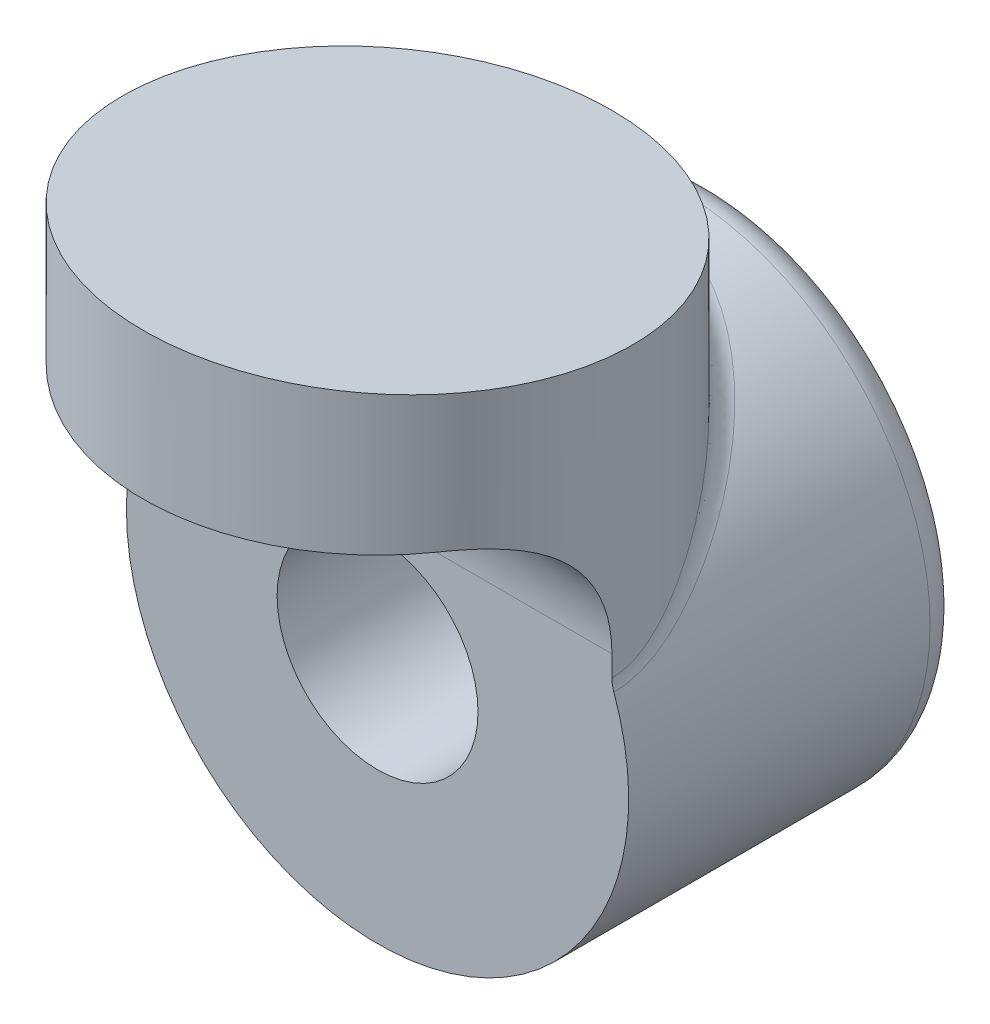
ISO-10303-21;
HEADER;
FILE_DESCRIPTION(('STEP AP214'),'2;1');
FILE_NAME('part.step','',(''),(''),'','','');
FILE_SCHEMA(('AUTOMOTIVE_DESIGN { 1 0 10303 214 1 1 1 1 }'));
ENDSEC;
DATA;
#1=APPLICATION_CONTEXT('core data for automotive mechanical design processes');
#2=APPLICATION_PROTOCOL_DEFINITION('international standard','automotive_design',2000,#1);
#3=PRODUCT_CONTEXT('',#1,'mechanical');
#4=PRODUCT('Part','Part','',(#3));
#5=PRODUCT_RELATED_PRODUCT_CATEGORY('part','',(#4));
#6=PRODUCT_DEFINITION_FORMATION('','',#4);
#7=PRODUCT_DEFINITION_CONTEXT('part definition',#1,'design');
#8=PRODUCT_DEFINITION('design','',#6,#7);
#9=PRODUCT_DEFINITION_SHAPE('','',#8);
#10=(LENGTH_UNIT() NAMED_UNIT(*) SI_UNIT(.MILLI.,.METRE.));
#11=(NAMED_UNIT(*) PLANE_ANGLE_UNIT() SI_UNIT($,.RADIAN.));
#12=(NAMED_UNIT(*) SI_UNIT($,.STERADIAN.) SOLID_ANGLE_UNIT());
#13=UNCERTAINTY_MEASURE_WITH_UNIT(LENGTH_MEASURE(1.E-05),#10,'distance_accuracy_value','');
#14=(GEOMETRIC_REPRESENTATION_CONTEXT(3) GLOBAL_UNCERTAINTY_ASSIGNED_CONTEXT((#13)) GLOBAL_UNIT_ASSIGNED_CONTEXT((#10,
#11,#12)) REPRESENTATION_CONTEXT('',''));
#15=CARTESIAN_POINT('',(0.,0.,0.));
#16=DIRECTION('',(0.,0.,1.));
#17=DIRECTION('',(1.,0.,0.));
#18=AXIS2_PLACEMENT_3D('',#15,#16,#17);
#19=CARTESIAN_POINT('',(0.,0.,25.));
#20=DIRECTION('',(0.,0.,-1.));
#21=DIRECTION('',(-1.,0.,0.));
#22=AXIS2_PLACEMENT_3D('',#19,#20,#21);
#23=CYLINDRICAL_SURFACE('',#22,15.);
#24=CARTESIAN_POINT('',(0.,0.,7.));
#25=DIRECTION('',(0.,0.,-1.));
#26=DIRECTION('',(-1.,0.,0.));
#27=AXIS2_PLACEMENT_3D('',#24,#25,#26);
#28=CIRCLE('',#27,15.);
#29=CARTESIAN_POINT('',(-15.,0.,7.));
#30=VERTEX_POINT('',#29);
#31=EDGE_CURVE('E11',#30,#30,#28,.F.);
#32=ORIENTED_EDGE('',*,*,#31,.T.);
#33=EDGE_LOOP('',(#32));
#34=FACE_BOUND('',#33,.T.);
#35=CARTESIAN_POINT('',(0.,0.,25.));
#36=DIRECTION('',(0.,0.,1.));
#37=DIRECTION('',(1.,0.,0.));
#38=AXIS2_PLACEMENT_3D('',#35,#36,#37);
#39=CIRCLE('',#38,15.);
#40=CARTESIAN_POINT('',(-14.1176470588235,5.06873174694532,25.));
#41=VERTEX_POINT('',#40);
#42=CARTESIAN_POINT('',(14.1176470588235,5.06873174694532,25.));
#43=VERTEX_POINT('',#42);
#44=EDGE_CURVE('E93',#41,#43,#39,.T.);
#45=ORIENTED_EDGE('',*,*,#44,.F.);
#46=CARTESIAN_POINT('',(-10.7551732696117,10.4559192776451,35.3645304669));
#47=CARTESIAN_POINT('',(-10.2763768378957,10.9484191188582,34.526647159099));
#48=CARTESIAN_POINT('',(-10.6655468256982,11.8500418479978,34.0689641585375));
#49=CARTESIAN_POINT('',(-10.9089569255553,10.2977398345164,35.1595334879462));
#50=CARTESIAN_POINT('',(-10.4418105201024,10.7927080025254,34.347611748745));
#51=CARTESIAN_POINT('',(-10.8180489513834,11.6707718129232,33.8895918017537));
#52=CARTESIAN_POINT('',(-11.0574959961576,10.1379621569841,34.9510994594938));
#53=CARTESIAN_POINT('',(-10.603140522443,10.6336737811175,34.1636057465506));
#54=CARTESIAN_POINT('',(-10.9653501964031,11.4896904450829,33.7072120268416));
#55=CARTESIAN_POINT('',(-11.3442257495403,9.81605655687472,34.5275575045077));
#56=CARTESIAN_POINT('',(-10.9154315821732,10.3116917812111,33.7878522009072));
#57=CARTESIAN_POINT('',(-11.2496905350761,11.1248640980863,33.3366128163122));
#58=CARTESIAN_POINT('',(-11.4824171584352,9.65392880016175,34.312450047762));
#59=CARTESIAN_POINT('',(-11.0665615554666,10.1487086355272,33.5960935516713));
#60=CARTESIAN_POINT('',(-11.3867303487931,10.9411193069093,33.1483937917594));
#61=CARTESIAN_POINT('',(-11.748983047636,9.32769507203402,33.875127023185));
#62=CARTESIAN_POINT('',(-11.3587476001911,9.81935504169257,33.2045648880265));
#63=CARTESIAN_POINT('',(-11.6510748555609,10.5713877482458,32.7657361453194));
#64=CARTESIAN_POINT('',(-11.8773292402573,9.1635848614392,33.6528933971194));
#65=CARTESIAN_POINT('',(-11.4999437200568,9.65291702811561,33.0047389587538));
#66=CARTESIAN_POINT('',(-11.7783514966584,10.3853961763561,32.5712817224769));
#67=CARTESIAN_POINT('',(-12.1239095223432,8.83476333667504,33.2018870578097));
#68=CARTESIAN_POINT('',(-11.7717199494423,9.31822215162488,32.5977106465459));
#69=CARTESIAN_POINT('',(-12.0228769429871,10.0127317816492,32.1766511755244));
#70=CARTESIAN_POINT('',(-12.2421435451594,8.6700520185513,32.9731143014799));
#71=CARTESIAN_POINT('',(-11.9024590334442,9.14989227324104,32.3904620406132));
#72=CARTESIAN_POINT('',(-12.1401256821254,9.82605895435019,31.9764750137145));
#73=CARTESIAN_POINT('',(-12.4712623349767,8.3372285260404,32.5033993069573));
#74=CARTESIAN_POINT('',(-12.1561690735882,8.80874389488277,31.9636342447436));
#75=CARTESIAN_POINT('',(-12.3673351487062,9.44885899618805,31.5654743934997));
#76=CARTESIAN_POINT('',(-12.5819086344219,8.16912755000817,32.2622973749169));
#77=CARTESIAN_POINT('',(-12.2790680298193,8.63578713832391,31.7437763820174));
#78=CARTESIAN_POINT('',(-12.4770593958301,9.25834455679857,31.3545102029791));
#79=CARTESIAN_POINT('',(-12.792757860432,7.83481884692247,31.7726591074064));
#80=CARTESIAN_POINT('',(-12.5135441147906,8.29092477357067,31.2960587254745));
#81=CARTESIAN_POINT('',(-12.6861515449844,8.87946135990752,30.9260767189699));
#82=CARTESIAN_POINT('',(-12.8929611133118,7.66861106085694,31.524123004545));
#83=CARTESIAN_POINT('',(-12.6252731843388,8.11890736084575,31.0681208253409));
#84=CARTESIAN_POINT('',(-12.7855197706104,8.69109253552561,30.7086076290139));
#85=CARTESIAN_POINT('',(-13.0827617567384,7.34011378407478,31.0192535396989));
#86=CARTESIAN_POINT('',(-12.837094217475,7.77820209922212,30.6040264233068));
#87=CARTESIAN_POINT('',(-12.9737387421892,8.3187956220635,30.2668468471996));
#88=CARTESIAN_POINT('',(-13.1723739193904,7.17781909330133,30.7629316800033));
#89=CARTESIAN_POINT('',(-12.9373419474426,7.60938421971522,30.3677926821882));
#90=CARTESIAN_POINT('',(-13.0626041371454,8.13486163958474,30.0425652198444));
#91=CARTESIAN_POINT('',(-13.3409785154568,6.85935094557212,30.2411441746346));
#92=CARTESIAN_POINT('',(-13.1260733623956,7.27755424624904,29.8859792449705));
#93=CARTESIAN_POINT('',(-13.2298036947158,7.77393107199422,29.5860011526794));
#94=CARTESIAN_POINT('',(-13.4199743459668,6.70317554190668,29.9756814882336));
#95=CARTESIAN_POINT('',(-13.2146902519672,7.11439800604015,29.6402978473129));
#96=CARTESIAN_POINT('',(-13.3081412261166,7.59693228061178,29.3537213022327));
#97=CARTESIAN_POINT('',(-13.5432265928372,6.44934224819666,29.5216381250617));
#98=CARTESIAN_POINT('',(-13.3531159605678,6.84866875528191,29.2190980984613));
#99=CARTESIAN_POINT('',(-13.4303663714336,7.30925454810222,28.9564333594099));
#100=CARTESIAN_POINT('',(-13.5904560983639,6.34909290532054,29.3359559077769));
#101=CARTESIAN_POINT('',(-13.4061773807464,6.74365118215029,29.046767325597));
#102=CARTESIAN_POINT('',(-13.4772022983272,7.19563862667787,28.7939614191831));
#103=CARTESIAN_POINT('',(-13.6797047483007,6.15443969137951,28.959096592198));
#104=CARTESIAN_POINT('',(-13.5064765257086,6.53958034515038,28.6966812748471));
#105=CARTESIAN_POINT('',(-13.565707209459,6.975031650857,28.4642095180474));
#106=CARTESIAN_POINT('',(-13.7217238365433,6.06003588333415,28.7679194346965));
#107=CARTESIAN_POINT('',(-13.5537490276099,6.44047421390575,28.5188829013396));
#108=CARTESIAN_POINT('',(-13.6073761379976,6.86804066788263,28.296929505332));
#109=CARTESIAN_POINT('',(-13.8001636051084,5.87921500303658,28.3799507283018));
#110=CARTESIAN_POINT('',(-13.6420119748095,6.25053221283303,28.1577827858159));
#111=CARTESIAN_POINT('',(-13.6851622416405,6.66311033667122,27.9574568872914));
#112=CARTESIAN_POINT('',(-13.8365989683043,5.79277723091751,28.1831755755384));
#113=CARTESIAN_POINT('',(-13.6830510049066,6.15961983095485,27.9744489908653));
#114=CARTESIAN_POINT('',(-13.721293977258,6.56514752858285,27.7852786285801));
#115=CARTESIAN_POINT('',(-13.90359180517,5.63008650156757,27.7831166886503));
#116=CARTESIAN_POINT('',(-13.7585135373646,5.98843771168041,27.6014925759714));
#117=CARTESIAN_POINT('',(-13.7877285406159,6.38076470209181,27.4352271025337));
#118=CARTESIAN_POINT('',(-13.9341504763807,5.55383147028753,27.5798342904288));
#119=CARTESIAN_POINT('',(-13.7929683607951,5.90810782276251,27.4118125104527));
#120=CARTESIAN_POINT('',(-13.8180325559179,6.29434233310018,27.2573550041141));
#121=CARTESIAN_POINT('',(-14.0039944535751,5.37602562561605,27.0518924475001));
#122=CARTESIAN_POINT('',(-13.871668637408,5.72086343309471,26.9192204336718));
#123=CARTESIAN_POINT('',(-13.8872944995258,6.09282904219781,26.7954058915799));
#124=CARTESIAN_POINT('',(-14.038791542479,5.28373255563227,26.7221489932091));
#125=CARTESIAN_POINT('',(-13.9109710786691,5.62341118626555,26.6109641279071));
#126=CARTESIAN_POINT('',(-13.9218016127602,5.9882302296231,26.5068803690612));
#127=CARTESIAN_POINT('',(-14.0774854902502,5.17936131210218,26.217752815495));
#128=CARTESIAN_POINT('',(-13.954657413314,5.51322417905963,26.1392015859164));
#129=CARTESIAN_POINT('',(-13.9601731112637,5.86994282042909,26.0655337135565));
#130=CARTESIAN_POINT('',(-14.0881283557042,5.15026392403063,26.0482054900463));
#131=CARTESIAN_POINT('',(-13.9666738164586,5.48249990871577,25.9806226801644));
#132=CARTESIAN_POINT('',(-13.9707272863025,5.83696578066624,25.9171798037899));
#133=CARTESIAN_POINT('',(-14.1046797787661,5.10476262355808,25.7065969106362));
#134=CARTESIAN_POINT('',(-13.9853571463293,5.43446299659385,25.6611068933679));
#135=CARTESIAN_POINT('',(-13.9871407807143,5.78539764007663,25.6182722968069));
#136=CARTESIAN_POINT('',(-14.1105887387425,5.08835763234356,25.5345358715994));
#137=CARTESIAN_POINT('',(-13.9920305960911,5.41713380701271,25.5001197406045));
#138=CARTESIAN_POINT('',(-13.9930004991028,5.76680531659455,25.4677188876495));
#139=CARTESIAN_POINT('',(-14.1175088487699,5.06912762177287,25.1879070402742));
#140=CARTESIAN_POINT('',(-13.9998434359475,5.39682691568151,25.1758292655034));
#141=CARTESIAN_POINT('',(-13.9998629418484,5.74501130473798,25.1644186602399));
#142=CARTESIAN_POINT('',(-14.1184800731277,5.06641330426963,25.0133302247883));
#143=CARTESIAN_POINT('',(-14.0009404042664,5.39395921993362,25.0124619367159));
#144=CARTESIAN_POINT('',(-14.0008260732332,5.74193507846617,25.0116639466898));
#145=CARTESIAN_POINT('',(-14.1153846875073,5.07503041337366,24.664686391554));
#146=CARTESIAN_POINT('',(-13.9974456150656,5.4030592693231,24.6862721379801));
#147=CARTESIAN_POINT('',(-13.9977564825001,5.75170113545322,24.7066005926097));
#148=CARTESIAN_POINT('',(-14.1113180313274,5.08636196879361,24.4906193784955));
#149=CARTESIAN_POINT('',(-13.9928525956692,5.41503030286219,24.5233932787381));
#150=CARTESIAN_POINT('',(-13.9937237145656,5.76454356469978,24.5542919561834));
#151=CARTESIAN_POINT('',(-14.0982673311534,5.12242315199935,24.144135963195));
#152=CARTESIAN_POINT('',(-13.9781195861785,5.45310583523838,24.199280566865));
#153=CARTESIAN_POINT('',(-13.9807817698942,5.80541290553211,24.2511189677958));
#154=CARTESIAN_POINT('',(-14.089271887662,5.14718383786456,23.9717243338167));
#155=CARTESIAN_POINT('',(-13.9679617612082,5.47925586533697,24.0379976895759));
#156=CARTESIAN_POINT('',(-13.9718612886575,5.83347501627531,24.1002587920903));
#157=CARTESIAN_POINT('',(-14.066620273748,5.20876790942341,23.6301116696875));
#158=CARTESIAN_POINT('',(-13.942396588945,5.54425455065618,23.7185629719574));
#159=CARTESIAN_POINT('',(-13.949398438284,5.90327029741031,23.8013477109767));
#160=CARTESIAN_POINT('',(-14.0529632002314,5.24559363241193,23.4609112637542));
#161=CARTESIAN_POINT('',(-13.9269800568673,5.58312592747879,23.5603632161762));
#162=CARTESIAN_POINT('',(-13.9358551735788,5.94500611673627,23.6532973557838));
#163=CARTESIAN_POINT('',(-14.0146969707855,5.34717724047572,23.0565777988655));
#164=CARTESIAN_POINT('',(-13.8837979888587,5.69030246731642,23.1824165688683));
#165=CARTESIAN_POINT('',(-13.8979078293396,6.06013420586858,23.2995055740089));
#166=CARTESIAN_POINT('',(-13.9878958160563,5.4171779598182,22.8234075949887));
#167=CARTESIAN_POINT('',(-13.8535516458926,5.76414799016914,22.9645653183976));
#168=CARTESIAN_POINT('',(-13.8713300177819,6.13946835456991,23.0954816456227));
#169=CARTESIAN_POINT('',(-13.9264541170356,5.57323003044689,22.3654753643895));
#170=CARTESIAN_POINT('',(-13.7842849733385,5.92855930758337,22.5371066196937));
#171=CARTESIAN_POINT('',(-13.8104003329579,6.31632736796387,22.6947909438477));
#172=CARTESIAN_POINT('',(-13.8918087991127,5.65929114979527,22.1407185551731));
#173=CARTESIAN_POINT('',(-13.7452224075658,6.01921415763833,22.3274086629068));
#174=CARTESIAN_POINT('',(-13.7760437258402,6.41386330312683,22.4981287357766));
#175=CARTESIAN_POINT('',(-13.8152622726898,5.84367423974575,21.6984865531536));
#176=CARTESIAN_POINT('',(-13.659011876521,6.21317301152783,21.9152329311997));
#177=CARTESIAN_POINT('',(-13.7001350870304,6.62283080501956,22.1111757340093));
#178=CARTESIAN_POINT('',(-13.7733358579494,5.94203845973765,21.4810398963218));
#179=CARTESIAN_POINT('',(-13.6117944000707,6.31659908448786,21.7127069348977));
#180=CARTESIAN_POINT('',(-13.6585580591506,6.73431025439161,21.920909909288));
#181=CARTESIAN_POINT('',(-13.6828312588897,6.14758052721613,21.0535082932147));
#182=CARTESIAN_POINT('',(-13.5099891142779,6.53239891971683,21.3149834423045));
#183=CARTESIAN_POINT('',(-13.5688076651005,6.96725793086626,21.5468197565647));
#184=CARTESIAN_POINT('',(-13.6342540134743,6.25475712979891,20.8434223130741));
#185=CARTESIAN_POINT('',(-13.4553568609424,6.64484704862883,21.1197196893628));
#186=CARTESIAN_POINT('',(-13.5206352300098,7.0887247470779,21.3629945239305));
#187=CARTESIAN_POINT('',(-13.5247398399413,6.48844711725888,20.4055577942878));
#188=CARTESIAN_POINT('',(-13.3323227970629,6.88968996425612,20.7132086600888));
#189=CARTESIAN_POINT('',(-13.4120336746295,7.35357339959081,20.9798630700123));
#190=CARTESIAN_POINT('',(-13.4630219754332,6.61575675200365,20.1785796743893));
#191=CARTESIAN_POINT('',(-13.2630219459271,7.02291684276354,20.5027793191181));
#192=CARTESIAN_POINT('',(-13.3508301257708,7.49785765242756,20.781257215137));
#193=CARTESIAN_POINT('',(-13.3319940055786,6.8759858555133,19.731637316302));
#194=CARTESIAN_POINT('',(-13.1161313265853,7.29469714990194,20.0891348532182));
#195=CARTESIAN_POINT('',(-13.2208940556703,7.79278396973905,20.3901826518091));
#196=CARTESIAN_POINT('',(-13.2626820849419,7.00890666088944,19.5116747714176));
#197=CARTESIAN_POINT('',(-13.0384666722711,7.43334159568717,19.8858539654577));
#198=CARTESIAN_POINT('',(-13.1521597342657,7.94342754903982,20.197715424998));
#199=CARTESIAN_POINT('',(-13.1165833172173,7.27865285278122,19.0778370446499));
#200=CARTESIAN_POINT('',(-12.8750478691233,7.71408603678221,19.485696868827));
#201=CARTESIAN_POINT('',(-13.0072784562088,8.2491398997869,19.8181074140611));
#202=CARTESIAN_POINT('',(-13.0397906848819,7.4154812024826,18.8639667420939));
#203=CARTESIAN_POINT('',(-12.7892094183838,7.85627020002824,19.2887665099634));
#204=CARTESIAN_POINT('',(-12.9311257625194,8.40421202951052,19.6309708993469));
#205=CARTESIAN_POINT('',(-12.8788487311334,7.69160755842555,18.4418922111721));
#206=CARTESIAN_POINT('',(-12.6096563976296,8.14251383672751,18.9009726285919));
#207=CARTESIAN_POINT('',(-12.7715249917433,8.71715523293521,19.2616556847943));
#208=CARTESIAN_POINT('',(-12.7946985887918,7.83090583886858,18.2336886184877));
#209=CARTESIAN_POINT('',(-12.5158574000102,8.2866476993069,18.7100568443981));
#210=CARTESIAN_POINT('',(-12.6880761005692,8.87502661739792,19.0794775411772));
#211=CARTESIAN_POINT('',(-12.5309910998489,8.25128090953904,17.6163235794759));
#212=CARTESIAN_POINT('',(-12.2216426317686,8.72174716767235,18.1436538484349));
#213=CARTESIAN_POINT('',(-12.4265661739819,9.35145169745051,18.5392831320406));
#214=CARTESIAN_POINT('',(-12.3403730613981,8.5344694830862,17.2149879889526));
#215=CARTESIAN_POINT('',(-12.0098480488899,9.01282206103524,17.778160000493));
#216=CARTESIAN_POINT('',(-12.2375366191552,9.67239874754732,18.1881144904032));
#217=CARTESIAN_POINT('',(-11.9295228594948,9.09993302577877,16.4318333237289));
#218=CARTESIAN_POINT('',(-11.5561730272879,9.58998223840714,17.0694567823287));
#219=CARTESIAN_POINT('',(-11.830110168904,10.3132574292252,17.50285415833));
#220=CARTESIAN_POINT('',(-11.709302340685,9.3822083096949,16.0500066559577));
#221=CARTESIAN_POINT('',(-11.3135114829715,9.87646917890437,16.7259753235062));
#222=CARTESIAN_POINT('',(-11.6117248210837,10.6331694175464,17.1687558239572));
#223=CARTESIAN_POINT('',(-11.2127374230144,9.97190458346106,15.2649771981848));
#224=CARTESIAN_POINT('',(-10.7698768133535,10.470488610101,16.0246594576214));
#225=CARTESIAN_POINT('',(-11.1192979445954,11.3014918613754,16.4818550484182));
#226=CARTESIAN_POINT('',(-10.932889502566,10.27870159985,14.8639998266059));
#227=CARTESIAN_POINT('',(-10.4648383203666,10.7766549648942,15.6698663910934));
#228=CARTESIAN_POINT('',(-10.8417820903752,11.6491951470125,16.13099984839));
#229=CARTESIAN_POINT('',(-10.3346178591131,10.8800585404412,14.0875571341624));
#230=CARTESIAN_POINT('',(-9.81932589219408,11.3699585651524,14.9902249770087));
#231=CARTESIAN_POINT('',(-10.2484960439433,12.3307330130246,15.4516124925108));
#232=CARTESIAN_POINT('',(-10.0161813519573,11.1746143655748,13.7121003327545));
#233=CARTESIAN_POINT('',(-9.47765657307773,11.6571455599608,14.6654852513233));
#234=CARTESIAN_POINT('',(-9.93271317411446,12.6645629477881,15.123087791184));
#235=CARTESIAN_POINT('',(-9.34096200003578,11.7448315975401,12.9915489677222));
#236=CARTESIAN_POINT('',(-8.76213874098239,12.2053824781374,14.0505392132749));
#237=CARTESIAN_POINT('',(-9.26312064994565,13.3108091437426,14.4926053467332));
#238=CARTESIAN_POINT('',(-8.98431454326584,12.0205543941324,12.6463546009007));
#239=CARTESIAN_POINT('',(-8.38730302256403,12.4662597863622,13.7606219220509));
#240=CARTESIAN_POINT('',(-8.90944525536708,13.6232949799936,14.190560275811));
#241=CARTESIAN_POINT('',(-8.23114965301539,12.5482834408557,11.9897662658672));
#242=CARTESIAN_POINT('',(-7.60755878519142,12.9572298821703,13.2180557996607));
#243=CARTESIAN_POINT('',(-8.16255673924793,14.2213878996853,13.6160454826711));
#244=CARTESIAN_POINT('',(-7.8346383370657,12.8002933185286,11.6783671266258));
#245=CARTESIAN_POINT('',(-7.20186709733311,13.1866699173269,12.9662031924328));
#246=CARTESIAN_POINT('',(-7.76934968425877,14.50699909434,13.3435712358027));
#247=CARTESIAN_POINT('',(-7.15711732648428,13.1858343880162,11.2041115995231));
#248=CARTESIAN_POINT('',(-6.52371205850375,13.5294214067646,12.5914327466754));
#249=CARTESIAN_POINT('',(-7.09747468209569,14.9439456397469,12.9285976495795));
#250=CARTESIAN_POINT('',(-6.88793378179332,13.3285955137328,11.0290538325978));
#251=CARTESIAN_POINT('',(-6.25585648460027,13.6547958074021,12.454747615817));
#252=CARTESIAN_POINT('',(-6.83053433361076,15.1057415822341,12.7754221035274));
#253=CARTESIAN_POINT('',(-6.33454363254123,13.6003125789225,10.6966547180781));
#254=CARTESIAN_POINT('',(-5.7116479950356,13.8900933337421,12.198739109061));
#255=CARTESIAN_POINT('',(-6.28175576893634,15.4136875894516,12.4845728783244));
#256=CARTESIAN_POINT('',(-6.05034161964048,13.7292727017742,10.5393080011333));
#257=CARTESIAN_POINT('',(-5.43536698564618,13.9997135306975,12.0797531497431));
#258=CARTESIAN_POINT('',(-5.99992210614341,15.5598423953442,12.3468945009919));
#259=CARTESIAN_POINT('',(-5.46758850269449,13.9715808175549,10.2442220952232));
#260=CARTESIAN_POINT('',(-4.87592095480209,14.2026548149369,11.8598087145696));
#261=CARTESIAN_POINT('',(-5.4220252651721,15.8344582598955,12.0886943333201));
#262=CARTESIAN_POINT('',(-5.16903440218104,14.0849255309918,10.1064870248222));
#263=CARTESIAN_POINT('',(-4.59297941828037,14.2956297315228,11.7592305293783));
#264=CARTESIAN_POINT('',(-5.12595911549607,15.9629156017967,11.9681761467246));
#265=CARTESIAN_POINT('',(-4.55884745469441,14.2940863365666,9.85269312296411));
#266=CARTESIAN_POINT('',(-4.02201792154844,14.4646935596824,11.576545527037));
#267=CARTESIAN_POINT('',(-4.52085705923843,16.1999645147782,11.7461064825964));
#268=CARTESIAN_POINT('',(-4.24721470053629,14.3899025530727,9.73663413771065));
#269=CARTESIAN_POINT('',(-3.73439386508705,14.5404306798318,11.4948217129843));
#270=CARTESIAN_POINT('',(-4.21182124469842,16.3085562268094,11.6445548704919));
#271=CARTESIAN_POINT('',(-3.60945092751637,14.5630388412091,9.52715170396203));
#272=CARTESIAN_POINT('',(-3.15278875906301,14.6754637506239,11.3492270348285));
#273=CARTESIAN_POINT('',(-3.57937216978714,16.5047773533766,11.4612577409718));
#274=CARTESIAN_POINT('',(-3.28320691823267,14.640166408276,9.43396372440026));
#275=CARTESIAN_POINT('',(-2.85939173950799,14.7342422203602,11.2859168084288));
#276=CARTESIAN_POINT('',(-3.25584686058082,16.5921885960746,11.3797182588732));
#277=CARTESIAN_POINT('',(-2.62152203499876,14.772996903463,9.27359651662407));
#278=CARTESIAN_POINT('',(-2.27041981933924,14.8344066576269,11.1780821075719));
#279=CARTESIAN_POINT('',(-2.5996760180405,16.7427298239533,11.2393969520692));
#280=CARTESIAN_POINT('',(-2.28608268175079,14.8287033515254,9.20641301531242));
#281=CARTESIAN_POINT('',(-1.97560317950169,14.8755079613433,11.1338646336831));
#282=CARTESIAN_POINT('',(-2.26703199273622,16.8058637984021,11.1806113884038));
#283=CARTESIAN_POINT('',(-1.60968922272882,14.9172705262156,9.09964532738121));
#284=CARTESIAN_POINT('',(-1.38532179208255,14.9404760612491,11.0639884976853));
#285=CARTESIAN_POINT('',(-1.59627514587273,16.9062399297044,11.0871896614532));
#286=CARTESIAN_POINT('',(-1.26875106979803,14.9501882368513,9.05999229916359));
#287=CARTESIAN_POINT('',(-1.09074260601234,14.9641829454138,11.0385019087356));
#288=CARTESIAN_POINT('',(-1.25817814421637,16.9435466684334,11.0524932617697));
#289=CARTESIAN_POINT('',(-0.583961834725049,14.992548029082,9.00897128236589));
#290=CARTESIAN_POINT('',(-0.50067903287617,14.994711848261,11.0056832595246));
#291=CARTESIAN_POINT('',(-0.579095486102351,16.9915544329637,11.0078498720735));
#292=CARTESIAN_POINT('',(-0.240113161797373,15.0020079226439,8.99758183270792));
#293=CARTESIAN_POINT('',(-0.206161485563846,15.0014461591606,10.9984454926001));
#294=CARTESIAN_POINT('',(-0.238112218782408,17.0022756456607,10.9978841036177));
#295=CARTESIAN_POINT('',(0.264453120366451,14.9985351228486,9.00176409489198));
#296=CARTESIAN_POINT('',(0.22698725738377,14.9989470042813,11.0011318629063));
#297=CARTESIAN_POINT('',(0.262249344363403,16.9983398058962,11.0015435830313));
#298=CARTESIAN_POINT('',(0.425404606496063,14.9948294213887,9.00622617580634));
#299=CARTESIAN_POINT('',(0.365125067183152,14.9962970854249,11.0039800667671));
#300=CARTESIAN_POINT('',(0.421859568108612,16.9941400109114,11.0054479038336));
#301=CARTESIAN_POINT('',(0.746856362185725,14.9822585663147,9.02136506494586));
#302=CARTESIAN_POINT('',(0.641464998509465,14.9872687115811,11.0136847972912));
#303=CARTESIAN_POINT('',(0.740632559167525,16.9798930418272,11.0186944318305));
#304=CARTESIAN_POINT('',(0.907356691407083,14.9733941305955,9.03204100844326));
#305=CARTESIAN_POINT('',(0.779566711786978,14.9808973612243,11.0205336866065));
#306=CARTESIAN_POINT('',(0.89979538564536,16.9698466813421,11.0280358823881));
#307=CARTESIAN_POINT('',(1.40238625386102,14.9380696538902,9.07459116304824));
#308=CARTESIAN_POINT('',(1.2062822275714,14.9554285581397,11.0479138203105));
#309=CARTESIAN_POINT('',(1.39069970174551,16.9298122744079,11.0652672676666));
#310=CARTESIAN_POINT('',(1.73568480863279,14.9029645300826,9.11688464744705));
#311=CARTESIAN_POINT('',(1.49479421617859,14.9300693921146,11.0751787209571));
#312=CARTESIAN_POINT('',(1.72122076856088,16.8900264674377,11.1022740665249));
#313=CARTESIAN_POINT('',(2.39603251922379,14.8111552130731,9.22757656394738));
#314=CARTESIAN_POINT('',(2.07221998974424,14.8625314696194,11.1478251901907));
#315=CARTESIAN_POINT('',(2.37606558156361,16.7859759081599,11.1991294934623));
#316=CARTESIAN_POINT('',(2.72307689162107,14.7544351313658,9.29599419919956));
#317=CARTESIAN_POINT('',(2.36031483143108,14.8205414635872,11.193003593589));
#318=CARTESIAN_POINT('',(2.70038458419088,16.7216931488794,11.2589949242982));
#319=CARTESIAN_POINT('',(3.36892468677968,14.6205119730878,9.45770877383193));
#320=CARTESIAN_POINT('',(2.93640954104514,14.7192553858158,11.3020585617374));
#321=CARTESIAN_POINT('',(3.34085031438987,16.5699135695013,11.4004951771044));
#322=CARTESIAN_POINT('',(3.68770552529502,14.5432581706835,9.55106732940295));
#323=CARTESIAN_POINT('',(3.22371486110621,14.6601916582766,11.3656845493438));
#324=CARTESIAN_POINT('',(3.65697464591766,16.4823592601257,11.4821839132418));
#325=CARTESIAN_POINT('',(4.31415944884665,14.369890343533,9.76086945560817));
#326=CARTESIAN_POINT('',(3.79605221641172,14.5246319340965,11.5118674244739));
#327=CARTESIAN_POINT('',(4.2782081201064,16.2858757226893,11.6657607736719));
#328=CARTESIAN_POINT('',(4.62182676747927,14.2737666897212,9.87732481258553));
#329=CARTESIAN_POINT('',(4.08054188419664,14.4484508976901,11.5940832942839));
#330=CARTESIAN_POINT('',(4.58331154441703,16.1769355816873,11.7676592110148));
#331=CARTESIAN_POINT('',(5.22137916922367,14.065451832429,10.1301451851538));
#332=CARTESIAN_POINT('',(4.64253517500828,14.279662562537,11.776500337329));
#333=CARTESIAN_POINT('',(5.17786767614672,15.9408454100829,11.9888770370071));
#334=CARTESIAN_POINT('',(5.51338708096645,13.9534231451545,10.2663090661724));
#335=CARTESIAN_POINT('',(4.91968153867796,14.1875632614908,11.8761474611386));
#336=CARTESIAN_POINT('',(5.46744218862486,15.8138795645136,12.1080204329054));
#337=CARTESIAN_POINT('',(6.08369367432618,13.71438699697,10.5574654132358));
#338=CARTESIAN_POINT('',(5.46777056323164,13.9870708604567,12.0934744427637));
#339=CARTESIAN_POINT('',(6.03299622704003,15.5429719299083,12.3627822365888));
#340=CARTESIAN_POINT('',(6.36198636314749,13.5873730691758,10.7124660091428));
#341=CARTESIAN_POINT('',(5.7385090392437,13.8789914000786,12.2108095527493));
#342=CARTESIAN_POINT('',(6.30896981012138,15.399022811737,12.4984077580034));
#343=CARTESIAN_POINT('',(7.17455378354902,13.1867286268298,11.2026420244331));
#344=CARTESIAN_POINT('',(6.5326799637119,13.5340449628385,12.586145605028));
#345=CARTESIAN_POINT('',(7.11476583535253,14.9449591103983,12.927311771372));
#346=CARTESIAN_POINT('',(7.68736301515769,12.8931936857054,11.563356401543));
#347=CARTESIAN_POINT('',(7.04960313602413,13.2731401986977,12.8710533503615));
#348=CARTESIAN_POINT('',(7.62330165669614,14.6122861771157,13.2429368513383));
#349=CARTESIAN_POINT('',(8.52549168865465,12.3489479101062,12.2372987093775));
#350=CARTESIAN_POINT('',(7.91139530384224,12.7723876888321,13.4219772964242));
#351=CARTESIAN_POINT('',(8.45444592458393,13.995474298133,13.8326363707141));
#352=CARTESIAN_POINT('',(8.86472144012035,12.1071812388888,12.5381885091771));
#353=CARTESIAN_POINT('',(8.26404327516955,12.5470295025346,13.6710223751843));
#354=CARTESIAN_POINT('',(8.79084876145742,13.7214720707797,14.0959149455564));
#355=CARTESIAN_POINT('',(9.51065476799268,11.6066448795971,13.1656880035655));
#356=CARTESIAN_POINT('',(8.94158434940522,12.0727039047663,14.1990019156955));
#357=CARTESIAN_POINT('',(9.43139931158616,13.1541975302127,14.6449770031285));
#358=CARTESIAN_POINT('',(9.81735554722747,11.3478737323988,13.4922999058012));
#359=CARTESIAN_POINT('',(9.26719431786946,11.8240766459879,14.4774871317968));
#360=CARTESIAN_POINT('',(9.73554425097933,12.860923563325,14.9307624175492));
#361=CARTESIAN_POINT('',(10.3997517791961,10.8167055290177,14.169231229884));
#362=CARTESIAN_POINT('',(9.88954623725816,11.3072246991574,15.0620384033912));
#363=CARTESIAN_POINT('',(10.3130871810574,12.2589329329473,15.5230773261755));
#364=CARTESIAN_POINT('',(10.6753296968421,10.5442620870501,14.5196330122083));
#365=CARTESIAN_POINT('',(10.1870590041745,11.0390081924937,15.3680146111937));
#366=CARTESIAN_POINT('',(10.5863686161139,11.950163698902,15.8296788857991));
#367=CARTESIAN_POINT('',(11.1949587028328,9.99084164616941,15.2408511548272));
#368=CARTESIAN_POINT('',(10.7506055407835,10.4889285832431,16.0039315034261));
#369=CARTESIAN_POINT('',(11.1016673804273,11.3229538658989,16.4607447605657));
#370=CARTESIAN_POINT('',(11.4390181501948,9.70986693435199,15.6116620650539));
#371=CARTESIAN_POINT('',(11.0175365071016,10.2069495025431,16.3338660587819));
#372=CARTESIAN_POINT('',(11.3436929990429,11.004515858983,16.7852043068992));
#373=CARTESIAN_POINT('',(11.903015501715,9.13554531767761,16.3836180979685));
#374=CARTESIAN_POINT('',(11.5264325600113,9.62656160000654,17.0256474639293));
#375=CARTESIAN_POINT('',(11.8038237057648,10.3536180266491,17.460665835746));
#376=CARTESIAN_POINT('',(12.1220724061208,8.84207358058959,16.7853254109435));
#377=CARTESIAN_POINT('',(11.7685063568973,9.32746380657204,17.3884706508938));
#378=CARTESIAN_POINT('',(12.0210551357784,10.0210167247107,17.8121597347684));
#379=CARTESIAN_POINT('',(12.4268875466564,8.40263957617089,17.4038071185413));
#380=CARTESIAN_POINT('',(12.1071076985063,8.87571491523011,17.9521457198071));
#381=CARTESIAN_POINT('',(12.3233301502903,9.52299151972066,18.3533312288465));
#382=CARTESIAN_POINT('',(12.5245733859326,8.25621816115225,17.6127285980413));
#383=CARTESIAN_POINT('',(12.2155189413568,8.72522267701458,18.1424700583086));
#384=CARTESIAN_POINT('',(12.4202019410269,9.35704724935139,18.5361375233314));
#385=CARTESIAN_POINT('',(12.7120256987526,7.96457302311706,18.0361250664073));
#386=CARTESIAN_POINT('',(12.4237987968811,8.42475442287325,18.5291332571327));
#387=CARTESIAN_POINT('',(12.6060921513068,9.02651609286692,18.9066094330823));
#388=CARTESIAN_POINT('',(12.8017928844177,7.81934919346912,18.2505995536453));
#389=CARTESIAN_POINT('',(12.5237694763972,8.27470702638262,18.7255210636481));
#390=CARTESIAN_POINT('',(12.6951112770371,8.8619290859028,19.0942746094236));
#391=CARTESIAN_POINT('',(12.9731418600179,7.53163576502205,18.6848357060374));
#392=CARTESIAN_POINT('',(12.7147763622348,7.97683023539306,19.1239947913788));
#393=CARTESIAN_POINT('',(12.8650323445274,8.53585386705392,19.4742312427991));
#394=CARTESIAN_POINT('',(13.0547482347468,7.3891390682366,18.9045788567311));
#395=CARTESIAN_POINT('',(12.8059323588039,7.82891805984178,19.3261145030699));
#396=CARTESIAN_POINT('',(12.9459586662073,8.37435761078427,19.6665064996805));
#397=CARTESIAN_POINT('',(13.2100168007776,7.1078301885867,19.3505684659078));
#398=CARTESIAN_POINT('',(12.9794972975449,7.53642486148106,19.7370875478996));
#399=CARTESIAN_POINT('',(13.0999333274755,8.05554088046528,20.0567474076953));
#400=CARTESIAN_POINT('',(13.283680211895,6.96901744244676,19.5768139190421));
#401=CARTESIAN_POINT('',(13.0619959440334,7.39175464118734,19.946004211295));
#402=CARTESIAN_POINT('',(13.172982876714,7.89821976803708,20.2547121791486));
#403=CARTESIAN_POINT('',(13.4228265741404,6.69709009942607,20.0363651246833));
#404=CARTESIAN_POINT('',(13.2179149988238,7.10796292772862,20.3710165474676));
#405=CARTESIAN_POINT('',(13.3109696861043,7.59003544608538,20.6568194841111));
#406=CARTESIAN_POINT('',(13.4883202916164,6.56396815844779,20.2696610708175));
#407=CARTESIAN_POINT('',(13.2914290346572,6.96873752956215,20.5871739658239));
#408=CARTESIAN_POINT('',(13.3759176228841,7.4391639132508,20.8609534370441));
#409=CARTESIAN_POINT('',(13.6109289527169,6.30579059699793,20.7446046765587));
#410=CARTESIAN_POINT('',(13.4290994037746,6.69843477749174,21.0277935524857));
#411=CARTESIAN_POINT('',(13.4975045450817,7.14656267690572,21.2765290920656));
#412=CARTESIAN_POINT('',(13.6680473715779,6.1807316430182,20.9862488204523));
#413=CARTESIAN_POINT('',(13.4933356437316,6.56724754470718,21.2523355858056));
#414=CARTESIAN_POINT('',(13.554146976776,7.00482919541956,21.4879677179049));
#415=CARTESIAN_POINT('',(13.7595004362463,5.97372387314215,21.4140800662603));
#416=CARTESIAN_POINT('',(13.5962496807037,6.34983065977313,21.6504825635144));
#417=CARTESIAN_POINT('',(13.6448379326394,6.77022038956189,21.862320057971));
#418=CARTESIAN_POINT('',(13.7958674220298,5.88911521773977,21.5980500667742));
#419=CARTESIAN_POINT('',(13.6371931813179,6.26090235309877,21.8217770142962));
#420=CARTESIAN_POINT('',(13.680901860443,6.6743305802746,22.0232938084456));
#421=CARTESIAN_POINT('',(13.8635086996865,5.72806656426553,21.9717691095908));
#422=CARTESIAN_POINT('',(13.7133560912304,6.09155211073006,22.1699708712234));
#423=CARTESIAN_POINT('',(13.7479794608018,6.49180877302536,22.3502979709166));
#424=CARTESIAN_POINT('',(13.8947825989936,5.65162719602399,22.1615185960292));
#425=CARTESIAN_POINT('',(13.7486012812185,6.01108230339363,22.3469169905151));
#426=CARTESIAN_POINT('',(13.7789927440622,6.4051774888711,22.5163287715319));
#427=CARTESIAN_POINT('',(13.951741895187,5.50951403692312,22.546541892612));
#428=CARTESIAN_POINT('',(13.8127943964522,5.86143169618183,22.7061403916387));
#429=CARTESIAN_POINT('',(13.8354773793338,6.24411590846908,22.8532241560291));
#430=CARTESIAN_POINT('',(13.9774439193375,5.44380836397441,22.741797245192));
#431=CARTESIAN_POINT('',(13.8417847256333,5.79216887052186,22.88845365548));
#432=CARTESIAN_POINT('',(13.8609652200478,6.16964947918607,23.0240725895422));
#433=CARTESIAN_POINT('',(14.0228628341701,5.32572373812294,23.1383130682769));
#434=CARTESIAN_POINT('',(13.8930086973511,5.66767936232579,23.2588131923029));
#435=CARTESIAN_POINT('',(13.9060056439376,6.0358202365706,23.371023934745));
#436=CARTESIAN_POINT('',(14.0425820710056,5.27333956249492,23.339571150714));
#437=CARTESIAN_POINT('',(13.9152658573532,5.61240017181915,23.4469231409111));
#438=CARTESIAN_POINT('',(13.9255605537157,5.97645150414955,23.5471247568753));
#439=CARTESIAN_POINT('',(14.0715070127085,5.19557262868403,23.6981716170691));
#440=CARTESIAN_POINT('',(13.947910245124,5.5303325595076,23.7821966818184));
#441=CARTESIAN_POINT('',(13.9542444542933,5.88831564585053,23.860900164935));
#442=CARTESIAN_POINT('',(14.0821012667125,5.1667248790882,23.8544030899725));
#443=CARTESIAN_POINT('',(13.9598706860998,5.49987615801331,23.928303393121));
#444=CARTESIAN_POINT('',(13.9647504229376,5.85562152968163,23.997602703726));
#445=CARTESIAN_POINT('',(14.0992880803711,5.11963961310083,24.1691960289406));
#446=CARTESIAN_POINT('',(13.9792704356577,5.45017093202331,24.222712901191));
#447=CARTESIAN_POINT('',(13.9817940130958,5.80225822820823,24.2730465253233));
#448=CARTESIAN_POINT('',(14.1058812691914,5.10140042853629,24.3277571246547));
#449=CARTESIAN_POINT('',(13.9867157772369,5.43090693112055,24.3710543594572));
#450=CARTESIAN_POINT('',(13.9883322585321,5.78158715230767,24.4117874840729));
#451=CARTESIAN_POINT('',(14.1148854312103,5.07643464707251,24.6458652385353));
#452=CARTESIAN_POINT('',(13.9968811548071,5.40454440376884,24.6686474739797));
#453=CARTESIAN_POINT('',(13.9972613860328,5.75329260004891,24.6901320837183));
#454=CARTESIAN_POINT('',(14.117305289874,5.06968359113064,24.8054094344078));
#455=CARTESIAN_POINT('',(13.9996141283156,5.39741254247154,24.8179384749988));
#456=CARTESIAN_POINT('',(13.9996610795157,5.74564140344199,24.8297332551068));
#457=CARTESIAN_POINT('',(14.1179212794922,5.06796803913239,25.1245945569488));
#458=CARTESIAN_POINT('',(14.0003096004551,5.39560082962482,25.1165696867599));
#459=CARTESIAN_POINT('',(14.0002719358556,5.7436971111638,25.1090202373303));
#460=CARTESIAN_POINT('',(14.1161173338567,5.07300375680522,25.284235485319));
#461=CARTESIAN_POINT('',(13.9982722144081,5.40092067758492,25.2659532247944));
#462=CARTESIAN_POINT('',(13.9984830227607,5.74940425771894,25.2487060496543));
#463=CARTESIAN_POINT('',(14.1083562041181,5.09454725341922,25.6015990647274));
#464=CARTESIAN_POINT('',(13.9895100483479,5.42367001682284,25.5628573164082));
#465=CARTESIAN_POINT('',(13.9907865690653,5.77382022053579,25.5263991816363));
#466=CARTESIAN_POINT('',(14.1024190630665,5.11099966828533,25.759327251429));
#467=CARTESIAN_POINT('',(13.9828053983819,5.44104751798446,25.7104253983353));
#468=CARTESIAN_POINT('',(13.9848989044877,5.79246629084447,25.6644113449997));
#469=CARTESIAN_POINT('',(14.0865674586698,5.15452705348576,26.0726361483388));
#470=CARTESIAN_POINT('',(13.9649121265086,5.48699948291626,26.0034626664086));
#471=CARTESIAN_POINT('',(13.9691793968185,5.84179732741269,25.9385566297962));
#472=CARTESIAN_POINT('',(14.0766521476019,5.18160428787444,26.2282163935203));
#473=CARTESIAN_POINT('',(13.9537176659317,5.51558869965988,26.1489702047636));
#474=CARTESIAN_POINT('',(13.9593467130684,5.87248485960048,26.0746893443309));
#475=CARTESIAN_POINT('',(14.0529773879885,5.24547306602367,26.5376225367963));
#476=CARTESIAN_POINT('',(13.9270007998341,5.58298615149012,26.4382355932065));
#477=CARTESIAN_POINT('',(13.9358692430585,5.94486947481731,26.3454197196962));
#478=CARTESIAN_POINT('',(14.0391896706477,5.28233593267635,26.6914265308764));
#479=CARTESIAN_POINT('',(13.911439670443,5.62188623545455,26.582006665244));
#480=CARTESIAN_POINT('',(13.9221964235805,5.98664739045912,26.479998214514));
#481=CARTESIAN_POINT('',(14.0080542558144,5.36435877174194,26.9956435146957));
#482=CARTESIAN_POINT('',(13.8763171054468,5.70838824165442,26.866252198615));
#483=CARTESIAN_POINT('',(13.8913204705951,6.079606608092,26.7461880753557));
#484=CARTESIAN_POINT('',(13.9907067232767,5.40951835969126,27.1460566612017));
#485=CARTESIAN_POINT('',(13.8567473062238,5.7560095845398,27.0067578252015));
#486=CARTESIAN_POINT('',(13.8741175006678,6.13078747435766,26.8777995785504));
#487=CARTESIAN_POINT('',(13.9352307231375,5.55151514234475,27.5799141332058));
#488=CARTESIAN_POINT('',(13.7941595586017,5.90573450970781,27.4120680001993));
#489=CARTESIAN_POINT('',(13.8191038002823,6.29171716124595,27.2574248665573));
#490=CARTESIAN_POINT('',(13.8926465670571,5.65772958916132,27.858698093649));
#491=CARTESIAN_POINT('',(13.7461290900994,6.017658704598,27.6722249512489));
#492=CARTESIAN_POINT('',(13.7768745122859,6.41209353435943,27.5013608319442));
#493=CARTESIAN_POINT('',(13.7965677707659,5.88815320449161,28.40436521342));
#494=CARTESIAN_POINT('',(13.63792992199,6.26001614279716,28.1807410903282));
#495=CARTESIAN_POINT('',(13.6815963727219,6.67324029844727,27.9788195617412));
#496=CARTESIAN_POINT('',(13.7430521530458,6.01239683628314,28.6712242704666));
#497=CARTESIAN_POINT('',(13.5776587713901,6.39063320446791,28.4292195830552));
#498=CARTESIAN_POINT('',(13.6285267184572,6.81404974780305,28.2123212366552));
#499=CARTESIAN_POINT('',(13.6275413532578,6.26972935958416,29.1874829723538));
#500=CARTESIAN_POINT('',(13.4477875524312,6.66061154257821,28.9091414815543));
#501=CARTESIAN_POINT('',(13.5139785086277,7.10569327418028,28.6640476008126));
#502=CARTESIAN_POINT('',(13.5657988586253,6.40250965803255,29.4371548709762));
#503=CARTESIAN_POINT('',(13.3783776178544,6.79980701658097,29.1409921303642));
#504=CARTESIAN_POINT('',(13.4527505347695,7.25617761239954,28.8825105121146));
#505=CARTESIAN_POINT('',(13.4666054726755,6.60728997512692,29.8044742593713));
#506=CARTESIAN_POINT('',(13.2671836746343,7.01378847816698,29.4811095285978));
#507=CARTESIAN_POINT('',(13.3543837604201,7.4882619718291,29.2039149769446));
#508=CARTESIAN_POINT('',(13.4325253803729,6.67632931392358,29.9254613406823));
#509=CARTESIAN_POINT('',(13.2289503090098,7.08596168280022,29.5931810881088));
#510=CARTESIAN_POINT('',(13.3205876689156,7.56650655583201,29.3097786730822));
#511=CARTESIAN_POINT('',(13.3621833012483,6.81602358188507,30.1653698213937));
#512=CARTESIAN_POINT('',(13.1500930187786,7.23185569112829,29.8152142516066));
#513=CARTESIAN_POINT('',(13.250831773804,7.72482672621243,29.5196985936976));
#514=CARTESIAN_POINT('',(13.3259217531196,6.88667818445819,30.284291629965));
#515=CARTESIAN_POINT('',(13.109458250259,7.30559019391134,29.9251868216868));
#516=CARTESIAN_POINT('',(13.2148724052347,7.80490194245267,29.6237551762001));
#517=CARTESIAN_POINT('',(13.2885824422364,6.95798653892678,30.4022726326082));
#518=CARTESIAN_POINT('',(13.0677006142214,7.37983363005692,30.0340457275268));
#519=CARTESIAN_POINT('',(13.1778442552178,7.88571807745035,29.7269885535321));
#520=(BOUNDED_SURFACE() B_SPLINE_SURFACE(3,2,((#46,#47,#48),(#49,#50,#51),(#52,#53,#54),(#55,
#56,#57),(#58,#59,#60),(#61,#62,#63),(#64,#65,#66),(#67,#68,#69),(#70,#71,#72),(#73,#74,#75),
(#76,#77,#78),(#79,#80,#81),(#82,#83,#84),(#85,#86,#87),(#88,#89,#90),(#91,#92,#93),(#94,#95,
#96),(#97,#98,#99),(#100,#101,#102),(#103,#104,#105),(#106,#107,#108),(#109,#110,#111),(#112,
#113,#114),(#115,#116,#117),(#118,#119,#120),(#121,#122,#123),(#124,#125,#126),(#127,#128,#129),
(#130,#131,#132),(#133,#134,#135),(#136,#137,#138),(#139,#140,#141),(#142,#143,#144),(#145,#146,
#147),(#148,#149,#150),(#151,#152,#153),(#154,#155,#156),(#157,#158,#159),(#160,#161,#162),
(#163,#164,#165),(#166,#167,#168),(#169,#170,#171),(#172,#173,#174),(#175,#176,#177),(#178,#179,
#180),(#181,#182,#183),(#184,#185,#186),(#187,#188,#189),(#190,#191,#192),(#193,#194,#195),
(#196,#197,#198),(#199,#200,#201),(#202,#203,#204),(#205,#206,#207),(#208,#209,#210),(#211,#212,
#213),(#214,#215,#216),(#217,#218,#219),(#220,#221,#222),(#223,#224,#225),(#226,#227,#228),
(#229,#230,#231),(#232,#233,#234),(#235,#236,#237),(#238,#239,#240),(#241,#242,#243),(#244,#245,
#246),(#247,#248,#249),(#250,#251,#252),(#253,#254,#255),(#256,#257,#258),(#259,#260,#261),
(#262,#263,#264),(#265,#266,#267),(#268,#269,#270),(#271,#272,#273),(#274,#275,#276),(#277,#278,
#279),(#280,#281,#282),(#283,#284,#285),(#286,#287,#288),(#289,#290,#291),(#292,#293,#294),
(#295,#296,#297),(#298,#299,#300),(#301,#302,#303),(#304,#305,#306),(#307,#308,#309),(#310,#311,
#312),(#313,#314,#315),(#316,#317,#318),(#319,#320,#321),(#322,#323,#324),(#325,#326,#327),
(#328,#329,#330),(#331,#332,#333),(#334,#335,#336),(#337,#338,#339),(#340,#341,#342),(#343,#344,
#345),(#346,#347,#348),(#349,#350,#351),(#352,#353,#354),(#355,#356,#357),(#358,#359,#360),
(#361,#362,#363),(#364,#365,#366),(#367,#368,#369),(#370,#371,#372),(#373,#374,#375),(#376,#377,
#378),(#379,#380,#381),(#382,#383,#384),(#385,#386,#387),(#388,#389,#390),(#391,#392,#393),
(#394,#395,#396),(#397,#398,#399),(#400,#401,#402),(#403,#404,#405),(#406,#407,#408),(#409,#410,
#411),(#412,#413,#414),(#415,#416,#417),(#418,#419,#420),(#421,#422,#423),(#424,#425,#426),
(#427,#428,#429),(#430,#431,#432),(#433,#434,#435),(#436,#437,#438),(#439,#440,#441),(#442,#443,
#444),(#445,#446,#447),(#448,#449,#450),(#451,#452,#453),(#454,#455,#456),(#457,#458,#459),
(#460,#461,#462),(#463,#464,#465),(#466,#467,#468),(#469,#470,#471),(#472,#473,#474),(#475,#476,
#477),(#478,#479,#480),(#481,#482,#483),(#484,#485,#486),(#487,#488,#489),(#490,#491,#492),
(#493,#494,#495),(#496,#497,#498),(#499,#500,#501),(#502,#503,#504),(#505,#506,#507),(#508,#509,
#510),(#511,#512,#513),(#514,#515,#516),(#517,#518,#519)),.UNSPECIFIED.,.F.,.F.,
.F.) B_SPLINE_SURFACE_WITH_KNOTS((4,2,2,2,2,2,2,2,2,2,2,2,2,2,2,2,2,2,2,2,2,2,2,2,2,2,2,2,2,2,2,
2,2,2,2,2,2,2,2,2,2,2,2,2,2,2,2,2,2,2,2,2,2,2,2,2,2,2,2,2,2,2,2,2,2,2,2,2,2,2,2,2,2,2,2,2,2,2,
4),(3,3),(0.,0.969861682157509,1.93965524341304,2.91213829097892,3.88462774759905,
4.88000575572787,5.87535265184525,6.86929446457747,7.86291746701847,8.53522367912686,
9.20753713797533,9.87805118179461,10.5484284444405,11.5886922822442,12.1075471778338,
12.6263579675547,13.1493571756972,13.6723611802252,14.1965799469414,14.7209003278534,
15.464103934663,16.2077610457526,16.9540458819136,17.7002254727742,18.533579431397,
19.3671330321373,20.2013364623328,21.035633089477,22.7064669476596,24.3766454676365,
26.2293836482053,28.0827373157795,29.9297287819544,31.7764372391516,32.9369740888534,
34.0971581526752,35.2575855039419,36.4180046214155,37.5899119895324,38.7616267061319,
39.9304008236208,41.0982871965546,41.6456616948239,42.192960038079,43.3375339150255,
44.4829507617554,45.6312239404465,46.7800845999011,47.9179541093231,49.0563164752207,
51.3298323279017,53.0073866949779,54.6850851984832,56.368921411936,58.0523101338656,
59.7834671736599,60.649904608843,61.516264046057,62.3799295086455,63.2434621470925,
64.1058444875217,64.967867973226,65.6021246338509,66.236430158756,66.8688159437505,
67.50095341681,67.9806823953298,68.4603359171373,68.9389669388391,69.4176066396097,
69.8939413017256,70.3703775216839,70.8503864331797,71.3303731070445,72.2510754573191,
73.173561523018,74.0723876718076,74.519864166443,74.9672509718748),(0.,1.),
.UNSPECIFIED.) GEOMETRIC_REPRESENTATION_ITEM() RATIONAL_B_SPLINE_SURFACE(((1.,0.879271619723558,
1.),(1.,0.883713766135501,1.),(1.,0.88806458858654,1.),(1.,0.896562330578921,1.),(1.,
0.900709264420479,1.),(1.,0.908789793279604,1.),(1.,0.912722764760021,1.),(1.,0.920345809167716,
1.),(1.,0.924035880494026,1.),(1.,0.931241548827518,1.),(1.,0.934750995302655,1.),(1.,
0.941483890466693,1.),(1.,0.94470734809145,1.),(1.,0.950848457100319,1.),(1.,0.953766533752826,
1.),(1.,0.959283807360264,1.),(1.,0.961883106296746,1.),(1.,0.965955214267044,1.),(1.,
0.967520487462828,1.),(1.,0.970485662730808,1.),(1.,0.971885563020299,1.),(1.,0.97450436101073,
1.),(1.,0.975723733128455,1.),(1.,0.977969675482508,1.),(1.,0.978996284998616,1.),(1.,
0.98134583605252,1.),(1.,0.982519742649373,1.),(1.,0.983826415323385,1.),(1.,0.984186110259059,
1.),(1.,0.984745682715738,1.),(1.,0.984945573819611,1.),(1.,0.985179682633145,1.),(1.,
0.985212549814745,1.),(1.,0.98510782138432,1.),(1.,0.98497022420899,1.),(1.,0.984528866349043,
1.),(1.,0.984224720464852,1.),(1.,0.983459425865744,1.),(1.,0.982998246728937,1.),(1.,
0.981707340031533,1.),(1.,0.980804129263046,1.),(1.,0.978737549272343,1.),(1.,0.977574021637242,
1.),(1.,0.975009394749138,1.),(1.,0.973607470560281,1.),(1.,0.970589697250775,1.),(1.,
0.968973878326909,1.),(1.,0.965342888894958,1.),(1.,0.963303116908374,1.),(1.,0.958990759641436,
1.),(1.,0.95671811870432,1.),(1.,0.95195055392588,1.),(1.,0.949455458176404,1.),(1.,
0.944254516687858,1.),(1.,0.941548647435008,1.),(1.,0.933120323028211,1.),(1.,0.927093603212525,
1.),(1.,0.91430809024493,1.),(1.,0.907549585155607,1.),(1.,0.89260978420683,1.),(1.,
0.884353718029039,1.),(1.,0.867201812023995,1.),(1.,0.858305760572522,1.),(1.,0.840136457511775,
1.),(1.,0.830864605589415,1.),(1.,0.812232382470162,1.),(1.,0.802872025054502,1.),(1.,
0.787920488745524,1.),(1.,0.7822211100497,1.),(1.,0.771098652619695,1.),(1.,0.765675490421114,
1.),(1.,0.755255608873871,1.),(1.,0.750258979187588,1.),(1.,0.740860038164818,1.),(1.,
0.736457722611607,1.),(1.,0.728378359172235,1.),(1.,0.724708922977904,1.),(1.,0.71831640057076,
1.),(1.,0.715593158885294,1.),(1.,0.711233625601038,1.),(1.,0.709594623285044,1.),(1.,
0.707481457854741,1.),(1.,0.70700641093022,1.),(1.,0.707180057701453,1.),(1.,0.707365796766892,
1.),(1.,0.707994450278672,1.),(1.,0.708437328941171,1.),(1.,0.710197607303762,1.),(1.,
0.711941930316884,1.),(1.,0.716451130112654,1.),(1.,0.719216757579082,1.),(1.,0.725645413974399,
1.),(1.,0.729310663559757,1.),(1.,0.737380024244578,1.),(1.,0.741784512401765,1.),(1.,
0.751120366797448,1.),(1.,0.756046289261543,1.),(1.,0.766304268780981,1.),(1.,0.771636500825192,
1.),(1.,0.788011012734,1.),(1.,0.799445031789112,1.),(1.,0.819383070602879,1.),(1.,
0.827869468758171,1.),(1.,0.844625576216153,1.),(1.,0.852895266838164,1.),(1.,0.869039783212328,
1.),(1.,0.876913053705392,1.),(1.,0.892081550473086,1.),(1.,0.899376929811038,1.),(1.,
0.913480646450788,1.),(1.,0.920269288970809,1.),(1.,0.929842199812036,1.),(1.,0.932932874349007,
1.),(1.,0.938900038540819,1.),(1.,0.94177654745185,1.),(1.,0.947296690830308,1.),(1.,
0.949941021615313,1.),(1.,0.954995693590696,1.),(1.,0.957406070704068,1.),(1.,0.961977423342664,
1.),(1.,0.964138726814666,1.),(1.,0.968198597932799,1.),(1.,0.970097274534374,1.),(1.,
0.973145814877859,1.),(1.,0.974360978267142,1.),(1.,0.976625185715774,1.),(1.,0.977674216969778,
1.),(1.,0.97958760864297,1.),(1.,0.980452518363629,1.),(1.,0.98198261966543,1.),(1.,
0.982647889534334,1.),(1.,0.983624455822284,1.),(1.,0.983982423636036,1.),(1.,0.984563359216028,
1.),(1.,0.984786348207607,1.),(1.,0.985090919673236,1.),(1.,0.98517280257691,1.),(1.,
0.985193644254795,1.),(1.,0.98513260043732,1.),(1.,0.984870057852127,1.),(1.,0.984669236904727,
1.),(1.,0.984133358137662,1.),(1.,0.983798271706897,1.),(1.,0.982998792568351,1.),(1.,
0.98253344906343,1.),(1.,0.98148362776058,1.),(1.,0.980899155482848,1.),(1.,0.97903221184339,
1.),(1.,0.977601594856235,1.),(1.,0.974383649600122,1.),(1.,0.972595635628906,1.),(1.,
0.968750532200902,1.),(1.,0.966701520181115,1.),(1.,0.963423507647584,1.),(1.,0.962299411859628,
1.),(1.,0.959984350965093,1.),(1.,0.958793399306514,1.),(1.,0.957569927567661,1.))) REPRESENTATION_ITEM('') SURFACE());
#521=CARTESIAN_POINT('',(-10.7551732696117,10.4559192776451,35.3645304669));
#522=CARTESIAN_POINT('',(-10.9089569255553,10.2977398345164,35.1595334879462));
#523=CARTESIAN_POINT('',(-11.0574959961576,10.1379621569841,34.9510994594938));
#524=CARTESIAN_POINT('',(-11.3442257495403,9.81605655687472,34.5275575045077));
#525=CARTESIAN_POINT('',(-11.4824171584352,9.65392880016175,34.312450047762));
#526=CARTESIAN_POINT('',(-11.748983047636,9.32769507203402,33.875127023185));
#527=CARTESIAN_POINT('',(-11.8773292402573,9.1635848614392,33.6528933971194));
#528=CARTESIAN_POINT('',(-12.1239095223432,8.83476333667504,33.2018870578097));
#529=CARTESIAN_POINT('',(-12.2421435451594,8.6700520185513,32.9731143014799));
#530=CARTESIAN_POINT('',(-12.4712623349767,8.3372285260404,32.5033993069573));
#531=CARTESIAN_POINT('',(-12.5819086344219,8.16912755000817,32.2622973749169));
#532=CARTESIAN_POINT('',(-12.792757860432,7.83481884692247,31.7726591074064));
#533=CARTESIAN_POINT('',(-12.8929611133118,7.66861106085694,31.524123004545));
#534=CARTESIAN_POINT('',(-13.0827617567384,7.34011378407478,31.0192535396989));
#535=CARTESIAN_POINT('',(-13.1723739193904,7.17781909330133,30.7629316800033));
#536=CARTESIAN_POINT('',(-13.3409785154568,6.85935094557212,30.2411441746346));
#537=CARTESIAN_POINT('',(-13.4199743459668,6.70317554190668,29.9756814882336));
#538=CARTESIAN_POINT('',(-13.5432265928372,6.44934224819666,29.5216381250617));
#539=CARTESIAN_POINT('',(-13.5904560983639,6.34909290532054,29.3359559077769));
#540=CARTESIAN_POINT('',(-13.6797047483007,6.15443969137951,28.959096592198));
#541=CARTESIAN_POINT('',(-13.7217238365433,6.06003588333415,28.7679194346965));
#542=CARTESIAN_POINT('',(-13.8001636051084,5.87921500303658,28.3799507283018));
#543=CARTESIAN_POINT('',(-13.8365989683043,5.79277723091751,28.1831755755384));
#544=CARTESIAN_POINT('',(-13.90359180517,5.63008650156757,27.7831166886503));
#545=CARTESIAN_POINT('',(-13.9341504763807,5.55383147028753,27.5798342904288));
#546=CARTESIAN_POINT('',(-14.0039944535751,5.37602562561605,27.0518924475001));
#547=CARTESIAN_POINT('',(-14.038791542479,5.28373255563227,26.7221489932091));
#548=CARTESIAN_POINT('',(-14.0774854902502,5.17936131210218,26.217752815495));
#549=CARTESIAN_POINT('',(-14.0881283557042,5.15026392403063,26.0482054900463));
#550=CARTESIAN_POINT('',(-14.1046797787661,5.10476262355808,25.7065969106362));
#551=CARTESIAN_POINT('',(-14.1105887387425,5.08835763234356,25.5345358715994));
#552=CARTESIAN_POINT('',(-14.1175088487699,5.06912762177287,25.1879070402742));
#553=CARTESIAN_POINT('',(-14.1184800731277,5.06641330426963,25.0133302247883));
#554=CARTESIAN_POINT('',(-14.1153846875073,5.07503041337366,24.664686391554));
#555=CARTESIAN_POINT('',(-14.1113180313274,5.08636196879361,24.4906193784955));
#556=CARTESIAN_POINT('',(-14.0982673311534,5.12242315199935,24.144135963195));
#557=CARTESIAN_POINT('',(-14.089271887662,5.14718383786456,23.9717243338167));
#558=CARTESIAN_POINT('',(-14.066620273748,5.20876790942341,23.6301116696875));
#559=CARTESIAN_POINT('',(-14.0529632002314,5.24559363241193,23.4609112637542));
#560=CARTESIAN_POINT('',(-14.0146969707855,5.34717724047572,23.0565777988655));
#561=CARTESIAN_POINT('',(-13.9878958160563,5.4171779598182,22.8234075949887));
#562=CARTESIAN_POINT('',(-13.9264541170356,5.57323003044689,22.3654753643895));
#563=CARTESIAN_POINT('',(-13.8918087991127,5.65929114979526,22.1407185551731));
#564=CARTESIAN_POINT('',(-13.8152622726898,5.84367423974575,21.6984865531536));
#565=CARTESIAN_POINT('',(-13.7733358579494,5.94203845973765,21.4810398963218));
#566=CARTESIAN_POINT('',(-13.6828312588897,6.14758052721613,21.0535082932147));
#567=CARTESIAN_POINT('',(-13.6342540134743,6.25475712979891,20.8434223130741));
#568=CARTESIAN_POINT('',(-13.5247398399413,6.48844711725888,20.4055577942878));
#569=CARTESIAN_POINT('',(-13.4630219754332,6.61575675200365,20.1785796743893));
#570=CARTESIAN_POINT('',(-13.3319940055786,6.8759858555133,19.731637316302));
#571=CARTESIAN_POINT('',(-13.2626820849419,7.00890666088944,19.5116747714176));
#572=CARTESIAN_POINT('',(-13.1165833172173,7.27865285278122,19.0778370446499));
#573=CARTESIAN_POINT('',(-13.0397906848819,7.4154812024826,18.8639667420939));
#574=CARTESIAN_POINT('',(-12.8788487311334,7.69160755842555,18.4418922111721));
#575=CARTESIAN_POINT('',(-12.7946985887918,7.83090583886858,18.2336886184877));
#576=CARTESIAN_POINT('',(-12.5309910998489,8.25128090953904,17.6163235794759));
#577=CARTESIAN_POINT('',(-12.3403730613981,8.5344694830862,17.2149879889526));
#578=CARTESIAN_POINT('',(-11.9295228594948,9.09993302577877,16.4318333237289));
#579=CARTESIAN_POINT('',(-11.709302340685,9.38220830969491,16.0500066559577));
#580=CARTESIAN_POINT('',(-11.2127374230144,9.97190458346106,15.2649771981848));
#581=CARTESIAN_POINT('',(-10.932889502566,10.27870159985,14.8639998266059));
#582=CARTESIAN_POINT('',(-10.3346178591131,10.8800585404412,14.0875571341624));
#583=CARTESIAN_POINT('',(-10.0161813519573,11.1746143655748,13.7121003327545));
#584=CARTESIAN_POINT('',(-9.34096200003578,11.7448315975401,12.9915489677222));
#585=CARTESIAN_POINT('',(-8.98431454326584,12.0205543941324,12.6463546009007));
#586=CARTESIAN_POINT('',(-8.23114965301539,12.5482834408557,11.9897662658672));
#587=CARTESIAN_POINT('',(-7.8346383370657,12.8002933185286,11.6783671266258));
#588=CARTESIAN_POINT('',(-7.15711732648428,13.1858343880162,11.2041115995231));
#589=CARTESIAN_POINT('',(-6.88793378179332,13.3285955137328,11.0290538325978));
#590=CARTESIAN_POINT('',(-6.33454363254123,13.6003125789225,10.6966547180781));
#591=CARTESIAN_POINT('',(-6.05034161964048,13.7292727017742,10.5393080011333));
#592=CARTESIAN_POINT('',(-5.46758850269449,13.9715808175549,10.2442220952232));
#593=CARTESIAN_POINT('',(-5.16903440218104,14.0849255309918,10.1064870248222));
#594=CARTESIAN_POINT('',(-4.55884745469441,14.2940863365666,9.85269312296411));
#595=CARTESIAN_POINT('',(-4.24721470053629,14.3899025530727,9.73663413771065));
#596=CARTESIAN_POINT('',(-3.60945092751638,14.5630388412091,9.52715170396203));
#597=CARTESIAN_POINT('',(-3.28320691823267,14.640166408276,9.43396372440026));
#598=CARTESIAN_POINT('',(-2.62152203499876,14.772996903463,9.27359651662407));
#599=CARTESIAN_POINT('',(-2.28608268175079,14.8287033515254,9.20641301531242));
#600=CARTESIAN_POINT('',(-1.60968922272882,14.9172705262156,9.09964532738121));
#601=CARTESIAN_POINT('',(-1.26875106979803,14.9501882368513,9.05999229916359));
#602=CARTESIAN_POINT('',(-0.58396183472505,14.992548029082,9.00897128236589));
#603=CARTESIAN_POINT('',(-0.240113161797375,15.0020079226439,8.99758183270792));
#604=CARTESIAN_POINT('',(0.26445312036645,14.9985351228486,9.00176409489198));
#605=CARTESIAN_POINT('',(0.425404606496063,14.9948294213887,9.00622617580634));
#606=CARTESIAN_POINT('',(0.746856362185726,14.9822585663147,9.02136506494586));
#607=CARTESIAN_POINT('',(0.907356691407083,14.9733941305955,9.03204100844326));
#608=CARTESIAN_POINT('',(1.40238625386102,14.9380696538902,9.07459116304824));
#609=CARTESIAN_POINT('',(1.73568480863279,14.9029645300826,9.11688464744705));
#610=CARTESIAN_POINT('',(2.39603251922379,14.8111552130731,9.22757656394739));
#611=CARTESIAN_POINT('',(2.72307689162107,14.7544351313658,9.29599419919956));
#612=CARTESIAN_POINT('',(3.36892468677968,14.6205119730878,9.45770877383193));
#613=CARTESIAN_POINT('',(3.68770552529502,14.5432581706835,9.55106732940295));
#614=CARTESIAN_POINT('',(4.31415944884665,14.369890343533,9.76086945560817));
#615=CARTESIAN_POINT('',(4.62182676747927,14.2737666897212,9.87732481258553));
#616=CARTESIAN_POINT('',(5.22137916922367,14.065451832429,10.1301451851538));
#617=CARTESIAN_POINT('',(5.51338708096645,13.9534231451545,10.2663090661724));
#618=CARTESIAN_POINT('',(6.08369367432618,13.71438699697,10.5574654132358));
#619=CARTESIAN_POINT('',(6.36198636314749,13.5873730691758,10.7124660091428));
#620=CARTESIAN_POINT('',(7.17455378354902,13.1867286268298,11.2026420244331));
#621=CARTESIAN_POINT('',(7.68736301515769,12.8931936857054,11.563356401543));
#622=CARTESIAN_POINT('',(8.52549168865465,12.3489479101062,12.2372987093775));
#623=CARTESIAN_POINT('',(8.86472144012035,12.1071812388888,12.5381885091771));
#624=CARTESIAN_POINT('',(9.51065476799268,11.6066448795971,13.1656880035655));
#625=CARTESIAN_POINT('',(9.81735554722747,11.3478737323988,13.4922999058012));
#626=CARTESIAN_POINT('',(10.3997517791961,10.8167055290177,14.169231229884));
#627=CARTESIAN_POINT('',(10.6753296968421,10.5442620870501,14.5196330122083));
#628=CARTESIAN_POINT('',(11.1949587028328,9.99084164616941,15.2408511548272));
#629=CARTESIAN_POINT('',(11.4390181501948,9.70986693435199,15.6116620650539));
#630=CARTESIAN_POINT('',(11.903015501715,9.13554531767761,16.3836180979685));
#631=CARTESIAN_POINT('',(12.1220724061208,8.84207358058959,16.7853254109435));
#632=CARTESIAN_POINT('',(12.4268875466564,8.40263957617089,17.4038071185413));
#633=CARTESIAN_POINT('',(12.5245733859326,8.25621816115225,17.6127285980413));
#634=CARTESIAN_POINT('',(12.7120256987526,7.96457302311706,18.0361250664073));
#635=CARTESIAN_POINT('',(12.8017928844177,7.81934919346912,18.2505995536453));
#636=CARTESIAN_POINT('',(12.9731418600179,7.53163576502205,18.6848357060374));
#637=CARTESIAN_POINT('',(13.0547482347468,7.3891390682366,18.9045788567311));
#638=CARTESIAN_POINT('',(13.2100168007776,7.1078301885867,19.3505684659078));
#639=CARTESIAN_POINT('',(13.283680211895,6.96901744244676,19.5768139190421));
#640=CARTESIAN_POINT('',(13.4228265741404,6.69709009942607,20.0363651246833));
#641=CARTESIAN_POINT('',(13.4883202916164,6.56396815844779,20.2696610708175));
#642=CARTESIAN_POINT('',(13.6109289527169,6.30579059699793,20.7446046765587));
#643=CARTESIAN_POINT('',(13.6680473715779,6.1807316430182,20.9862488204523));
#644=CARTESIAN_POINT('',(13.7595004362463,5.97372387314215,21.4140800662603));
#645=CARTESIAN_POINT('',(13.7958674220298,5.88911521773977,21.5980500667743));
#646=CARTESIAN_POINT('',(13.8635086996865,5.72806656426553,21.9717691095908));
#647=CARTESIAN_POINT('',(13.8947825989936,5.65162719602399,22.1615185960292));
#648=CARTESIAN_POINT('',(13.951741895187,5.50951403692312,22.546541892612));
#649=CARTESIAN_POINT('',(13.9774439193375,5.44380836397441,22.7417972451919));
#650=CARTESIAN_POINT('',(14.0228628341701,5.32572373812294,23.1383130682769));
#651=CARTESIAN_POINT('',(14.0425820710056,5.27333956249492,23.339571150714));
#652=CARTESIAN_POINT('',(14.0715070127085,5.19557262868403,23.6981716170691));
#653=CARTESIAN_POINT('',(14.0821012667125,5.1667248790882,23.8544030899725));
#654=CARTESIAN_POINT('',(14.0992880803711,5.11963961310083,24.1691960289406));
#655=CARTESIAN_POINT('',(14.1058812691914,5.10140042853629,24.3277571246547));
#656=CARTESIAN_POINT('',(14.1148854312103,5.07643464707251,24.6458652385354));
#657=CARTESIAN_POINT('',(14.117305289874,5.06968359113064,24.8054094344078));
#658=CARTESIAN_POINT('',(14.1179212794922,5.06796803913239,25.1245945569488));
#659=CARTESIAN_POINT('',(14.1161173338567,5.07300375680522,25.284235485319));
#660=CARTESIAN_POINT('',(14.1083562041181,5.09454725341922,25.6015990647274));
#661=CARTESIAN_POINT('',(14.1024190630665,5.11099966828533,25.759327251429));
#662=CARTESIAN_POINT('',(14.0865674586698,5.15452705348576,26.0726361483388));
#663=CARTESIAN_POINT('',(14.0766521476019,5.18160428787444,26.2282163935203));
#664=CARTESIAN_POINT('',(14.0529773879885,5.24547306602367,26.5376225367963));
#665=CARTESIAN_POINT('',(14.0391896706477,5.28233593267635,26.6914265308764));
#666=CARTESIAN_POINT('',(14.0080542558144,5.36435877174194,26.9956435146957));
#667=CARTESIAN_POINT('',(13.9907067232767,5.40951835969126,27.1460566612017));
#668=CARTESIAN_POINT('',(13.9352307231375,5.55151514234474,27.5799141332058));
#669=CARTESIAN_POINT('',(13.8926465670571,5.65772958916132,27.858698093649));
#670=CARTESIAN_POINT('',(13.7965677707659,5.88815320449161,28.40436521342));
#671=CARTESIAN_POINT('',(13.7430521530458,6.01239683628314,28.6712242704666));
#672=CARTESIAN_POINT('',(13.6275413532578,6.26972935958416,29.1874829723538));
#673=CARTESIAN_POINT('',(13.5657988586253,6.40250965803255,29.4371548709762));
#674=CARTESIAN_POINT('',(13.4666054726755,6.60728997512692,29.8044742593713));
#675=CARTESIAN_POINT('',(13.4325253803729,6.67632931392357,29.9254613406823));
#676=CARTESIAN_POINT('',(13.3621833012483,6.81602358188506,30.1653698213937));
#677=CARTESIAN_POINT('',(13.3259217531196,6.88667818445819,30.284291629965));
#678=CARTESIAN_POINT('',(13.2885824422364,6.95798653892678,30.4022726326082));
#679=B_SPLINE_CURVE_WITH_KNOTS('',3,(#521,#522,#523,#524,#525,#526,#527,#528,#529,#530,#531,
#532,#533,#534,#535,#536,#537,#538,#539,#540,#541,#542,#543,#544,#545,#546,#547,#548,#549,#550,
#551,#552,#553,#554,#555,#556,#557,#558,#559,#560,#561,#562,#563,#564,#565,#566,#567,#568,#569,
#570,#571,#572,#573,#574,#575,#576,#577,#578,#579,#580,#581,#582,#583,#584,#585,#586,#587,#588,
#589,#590,#591,#592,#593,#594,#595,#596,#597,#598,#599,#600,#601,#602,#603,#604,#605,#606,#607,
#608,#609,#610,#611,#612,#613,#614,#615,#616,#617,#618,#619,#620,#621,#622,#623,#624,#625,#626,
#627,#628,#629,#630,#631,#632,#633,#634,#635,#636,#637,#638,#639,#640,#641,#642,#643,#644,#645,
#646,#647,#648,#649,#650,#651,#652,#653,#654,#655,#656,#657,#658,#659,#660,#661,#662,#663,#664,
#665,#666,#667,#668,#669,#670,#671,#672,#673,#674,#675,#676,#677,#678),.UNSPECIFIED.,.F.,.F.,(4,
2,2,2,2,2,2,2,2,2,2,2,2,2,2,2,2,2,2,2,2,2,2,2,2,2,2,2,2,2,2,2,2,2,2,2,2,2,2,2,2,2,2,2,2,2,2,2,2,
2,2,2,2,2,2,2,2,2,2,2,2,2,2,2,2,2,2,2,2,2,2,2,2,2,2,2,2,2,4),(0.,0.969861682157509,
1.93965524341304,2.91213829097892,3.88462774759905,4.88000575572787,5.87535265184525,
6.86929446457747,7.86291746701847,8.53522367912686,9.20753713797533,9.87805118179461,
10.5484284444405,11.5886922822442,12.1075471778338,12.6263579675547,13.1493571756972,
13.6723611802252,14.1965799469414,14.7209003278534,15.464103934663,16.2077610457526,
16.9540458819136,17.7002254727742,18.533579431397,19.3671330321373,20.2013364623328,
21.035633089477,22.7064669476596,24.3766454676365,26.2293836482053,28.0827373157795,
29.9297287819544,31.7764372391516,32.9369740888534,34.0971581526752,35.2575855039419,
36.4180046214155,37.5899119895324,38.7616267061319,39.9304008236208,41.0982871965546,
41.6456616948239,42.192960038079,43.3375339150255,44.4829507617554,45.6312239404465,
46.7800845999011,47.9179541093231,49.0563164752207,51.3298323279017,53.0073866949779,
54.6850851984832,56.368921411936,58.0523101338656,59.7834671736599,60.649904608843,
61.516264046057,62.3799295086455,63.2434621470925,64.1058444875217,64.967867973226,
65.6021246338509,66.236430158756,66.8688159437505,67.50095341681,67.9806823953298,
68.4603359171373,68.9389669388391,69.4176066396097,69.8939413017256,70.3703775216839,
70.8503864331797,71.3303731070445,72.2510754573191,73.173561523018,74.0723876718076,
74.519864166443,74.9672509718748),.UNSPECIFIED.);
#680=EDGE_CURVE('E79',#41,#43,#679,.T.);
#681=ORIENTED_EDGE('',*,*,#680,.T.);
#682=EDGE_LOOP('',(#45,#681));
#683=FACE_BOUND('',#682,.T.);
#684=ADVANCED_FACE('F30',(#34,#683),#23,.T.);
#685=CARTESIAN_POINT('',(0.,0.,25.));
#686=DIRECTION('',(0.,0.,-1.));
#687=DIRECTION('',(-1.,0.,0.));
#688=AXIS2_PLACEMENT_3D('',#685,#686,#687);
#689=CYLINDRICAL_SURFACE('',#688,6.);
#690=CARTESIAN_POINT('',(0.,0.,25.));
#691=DIRECTION('',(0.,0.,1.));
#692=DIRECTION('',(1.,0.,0.));
#693=AXIS2_PLACEMENT_3D('',#690,#691,#692);
#694=CIRCLE('',#693,6.);
#695=CARTESIAN_POINT('',(6.,0.,25.));
#696=VERTEX_POINT('',#695);
#697=EDGE_CURVE('E163',#696,#696,#694,.T.);
#698=ORIENTED_EDGE('',*,*,#697,.T.);
#699=EDGE_LOOP('',(#698));
#700=FACE_BOUND('',#699,.T.);
#701=CARTESIAN_POINT('',(0.,0.,5.));
#702=DIRECTION('',(0.,0.,-1.));
#703=DIRECTION('',(-1.,0.,0.));
#704=AXIS2_PLACEMENT_3D('',#701,#702,#703);
#705=CIRCLE('',#704,6.);
#706=CARTESIAN_POINT('',(-6.,0.,5.));
#707=VERTEX_POINT('',#706);
#708=EDGE_CURVE('E149',#707,#707,#705,.T.);
#709=ORIENTED_EDGE('',*,*,#708,.T.);
#710=EDGE_LOOP('',(#709));
#711=FACE_BOUND('',#710,.T.);
#712=ADVANCED_FACE('F113',(#700,#711),#689,.F.);
#713=CARTESIAN_POINT('',(0.,0.,25.));
#714=DIRECTION('',(0.,-1.,0.));
#715=DIRECTION('',(0.,0.,-1.));
#716=AXIS2_PLACEMENT_3D('',#713,#714,#715);
#717=CYLINDRICAL_SURFACE('',#716,14.);
#718=CARTESIAN_POINT('',(0.,22.4193143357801,25.));
#719=DIRECTION('',(0.,-0.995675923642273,0.0928948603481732));
#720=DIRECTION('',(0.,-0.0928948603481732,-0.995675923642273));
#721=AXIS2_PLACEMENT_3D('',#718,#719,#720);
#722=ELLIPSE('',#721,14.0607999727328,14.);
#723=CARTESIAN_POINT('',(0.,21.1131382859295,11.));
#724=VERTEX_POINT('',#723);
#725=EDGE_CURVE('E86',#724,#724,#722,.F.);
#726=ORIENTED_EDGE('',*,*,#725,.F.);
#727=EDGE_LOOP('',(#726));
#728=FACE_BOUND('',#727,.T.);
#729=DIRECTION('',(0.,-1.,0.));
#730=VECTOR('',#729,1.);
#731=CARTESIAN_POINT('',(14.,0.,25.));
#732=LINE('',#731,#730);
#733=CARTESIAN_POINT('',(14.,7.,25.));
#734=VERTEX_POINT('',#733);
#735=CARTESIAN_POINT('',(14.,5.74456264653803,25.));
#736=VERTEX_POINT('',#735);
#737=EDGE_CURVE('E73',#734,#736,#732,.T.);
#738=ORIENTED_EDGE('',*,*,#737,.T.);
#739=CARTESIAN_POINT('',(13.1778442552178,7.88571807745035,29.7269885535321));
#740=CARTESIAN_POINT('',(13.2148724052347,7.80490194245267,29.6237551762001));
#741=CARTESIAN_POINT('',(13.250831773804,7.72482672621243,29.5196985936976));
#742=CARTESIAN_POINT('',(13.3205876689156,7.56650655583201,29.3097786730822));
#743=CARTESIAN_POINT('',(13.35438376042,7.4882619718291,29.2039149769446));
#744=CARTESIAN_POINT('',(13.4527505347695,7.25617761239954,28.8825105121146));
#745=CARTESIAN_POINT('',(13.5139785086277,7.10569327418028,28.6640476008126));
#746=CARTESIAN_POINT('',(13.6285267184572,6.81404974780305,28.2123212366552));
#747=CARTESIAN_POINT('',(13.6815963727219,6.67324029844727,27.9788195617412));
#748=CARTESIAN_POINT('',(13.7768745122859,6.41209353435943,27.5013608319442));
#749=CARTESIAN_POINT('',(13.8191038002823,6.29171716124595,27.2574248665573));
#750=CARTESIAN_POINT('',(13.8741175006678,6.13078747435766,26.8777995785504));
#751=CARTESIAN_POINT('',(13.8913204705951,6.079606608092,26.7461880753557));
#752=CARTESIAN_POINT('',(13.9221964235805,5.98664739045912,26.479998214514));
#753=CARTESIAN_POINT('',(13.9358692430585,5.94486947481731,26.3454197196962));
#754=CARTESIAN_POINT('',(13.9593467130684,5.87248485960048,26.0746893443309));
#755=CARTESIAN_POINT('',(13.9691793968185,5.84179732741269,25.9385566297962));
#756=CARTESIAN_POINT('',(13.9848989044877,5.79246629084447,25.6644113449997));
#757=CARTESIAN_POINT('',(13.9907865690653,5.77382022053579,25.5263991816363));
#758=CARTESIAN_POINT('',(13.9984830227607,5.74940425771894,25.2487060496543));
#759=CARTESIAN_POINT('',(14.0002719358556,5.7436971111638,25.1090202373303));
#760=CARTESIAN_POINT('',(13.9996610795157,5.74564140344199,24.8297332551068));
#761=CARTESIAN_POINT('',(13.9972613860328,5.75329260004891,24.6901320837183));
#762=CARTESIAN_POINT('',(13.9883322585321,5.78158715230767,24.4117874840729));
#763=CARTESIAN_POINT('',(13.9817940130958,5.80225822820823,24.2730465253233));
#764=CARTESIAN_POINT('',(13.9647504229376,5.85562152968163,23.997602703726));
#765=CARTESIAN_POINT('',(13.9542444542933,5.88831564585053,23.860900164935));
#766=CARTESIAN_POINT('',(13.9255605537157,5.97645150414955,23.5471247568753));
#767=CARTESIAN_POINT('',(13.9060056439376,6.0358202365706,23.371023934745));
#768=CARTESIAN_POINT('',(13.8609652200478,6.16964947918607,23.0240725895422));
#769=CARTESIAN_POINT('',(13.8354773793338,6.24411590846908,22.8532241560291));
#770=CARTESIAN_POINT('',(13.7789927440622,6.4051774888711,22.5163287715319));
#771=CARTESIAN_POINT('',(13.7479794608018,6.49180877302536,22.3502979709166));
#772=CARTESIAN_POINT('',(13.680901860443,6.6743305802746,22.0232938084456));
#773=CARTESIAN_POINT('',(13.6448379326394,6.77022038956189,21.862320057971));
#774=CARTESIAN_POINT('',(13.554146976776,7.00482919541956,21.4879677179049));
#775=CARTESIAN_POINT('',(13.4975045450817,7.14656267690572,21.2765290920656));
#776=CARTESIAN_POINT('',(13.3759176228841,7.4391639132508,20.8609534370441));
#777=CARTESIAN_POINT('',(13.3109696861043,7.59003544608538,20.6568194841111));
#778=CARTESIAN_POINT('',(13.172982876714,7.89821976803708,20.2547121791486));
#779=CARTESIAN_POINT('',(13.0999333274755,8.05554088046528,20.0567474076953));
#780=CARTESIAN_POINT('',(12.9459586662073,8.37435761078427,19.6665064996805));
#781=CARTESIAN_POINT('',(12.8650323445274,8.53585386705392,19.4742312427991));
#782=CARTESIAN_POINT('',(12.6951112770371,8.8619290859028,19.0942746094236));
#783=CARTESIAN_POINT('',(12.6060921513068,9.02651609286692,18.9066094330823));
#784=CARTESIAN_POINT('',(12.4202019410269,9.35704724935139,18.5361375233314));
#785=CARTESIAN_POINT('',(12.3233301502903,9.52299151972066,18.3533312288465));
#786=CARTESIAN_POINT('',(12.0210551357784,10.0210167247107,17.8121597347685));
#787=CARTESIAN_POINT('',(11.8038237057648,10.3536180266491,17.460665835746));
#788=CARTESIAN_POINT('',(11.3436929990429,11.004515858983,16.7852043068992));
#789=CARTESIAN_POINT('',(11.1016673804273,11.3229538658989,16.4607447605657));
#790=CARTESIAN_POINT('',(10.5863686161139,11.950163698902,15.8296788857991));
#791=CARTESIAN_POINT('',(10.3130871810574,12.2589329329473,15.5230773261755));
#792=CARTESIAN_POINT('',(9.73554425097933,12.860923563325,14.9307624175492));
#793=CARTESIAN_POINT('',(9.43139931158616,13.1541975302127,14.6449770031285));
#794=CARTESIAN_POINT('',(8.79084876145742,13.7214720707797,14.0959149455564));
#795=CARTESIAN_POINT('',(8.45444592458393,13.995474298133,13.8326363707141));
#796=CARTESIAN_POINT('',(7.62330165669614,14.6122861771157,13.2429368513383));
#797=CARTESIAN_POINT('',(7.11476583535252,14.9449591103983,12.927311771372));
#798=CARTESIAN_POINT('',(6.30896981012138,15.399022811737,12.4984077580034));
#799=CARTESIAN_POINT('',(6.03299622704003,15.5429719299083,12.3627822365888));
#800=CARTESIAN_POINT('',(5.46744218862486,15.8138795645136,12.1080204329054));
#801=CARTESIAN_POINT('',(5.17786767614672,15.9408454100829,11.9888770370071));
#802=CARTESIAN_POINT('',(4.58331154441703,16.1769355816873,11.7676592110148));
#803=CARTESIAN_POINT('',(4.27820812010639,16.2858757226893,11.6657607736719));
#804=CARTESIAN_POINT('',(3.65697464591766,16.4823592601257,11.4821839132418));
#805=CARTESIAN_POINT('',(3.34085031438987,16.5699135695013,11.4004951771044));
#806=CARTESIAN_POINT('',(2.70038458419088,16.7216931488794,11.2589949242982));
#807=CARTESIAN_POINT('',(2.37606558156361,16.7859759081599,11.1991294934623));
#808=CARTESIAN_POINT('',(1.72122076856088,16.8900264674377,11.1022740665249));
#809=CARTESIAN_POINT('',(1.39069970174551,16.9298122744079,11.0652672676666));
#810=CARTESIAN_POINT('',(0.89979538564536,16.9698466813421,11.0280358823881));
#811=CARTESIAN_POINT('',(0.740632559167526,16.9798930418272,11.0186944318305));
#812=CARTESIAN_POINT('',(0.421859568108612,16.9941400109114,11.0054479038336));
#813=CARTESIAN_POINT('',(0.262249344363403,16.9983398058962,11.0015435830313));
#814=CARTESIAN_POINT('',(-0.238112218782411,17.0022756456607,10.9978841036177));
#815=CARTESIAN_POINT('',(-0.579095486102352,16.9915544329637,11.0078498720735));
#816=CARTESIAN_POINT('',(-1.25817814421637,16.9435466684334,11.0524932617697));
#817=CARTESIAN_POINT('',(-1.59627514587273,16.9062399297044,11.0871896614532));
#818=CARTESIAN_POINT('',(-2.26703199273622,16.8058637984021,11.1806113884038));
#819=CARTESIAN_POINT('',(-2.5996760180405,16.7427298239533,11.2393969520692));
#820=CARTESIAN_POINT('',(-3.25584686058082,16.5921885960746,11.3797182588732));
#821=CARTESIAN_POINT('',(-3.57937216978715,16.5047773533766,11.4612577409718));
#822=CARTESIAN_POINT('',(-4.21182124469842,16.3085562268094,11.6445548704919));
#823=CARTESIAN_POINT('',(-4.52085705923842,16.1999645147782,11.7461064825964));
#824=CARTESIAN_POINT('',(-5.12595911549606,15.9629156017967,11.9681761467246));
#825=CARTESIAN_POINT('',(-5.4220252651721,15.8344582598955,12.0886943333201));
#826=CARTESIAN_POINT('',(-5.99992210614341,15.5598423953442,12.3468945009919));
#827=CARTESIAN_POINT('',(-6.28175576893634,15.4136875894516,12.4845728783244));
#828=CARTESIAN_POINT('',(-6.83053433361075,15.1057415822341,12.7754221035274));
#829=CARTESIAN_POINT('',(-7.09747468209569,14.9439456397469,12.9285976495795));
#830=CARTESIAN_POINT('',(-7.76934968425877,14.50699909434,13.3435712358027));
#831=CARTESIAN_POINT('',(-8.16255673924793,14.2213878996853,13.6160454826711));
#832=CARTESIAN_POINT('',(-8.90944525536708,13.6232949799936,14.190560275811));
#833=CARTESIAN_POINT('',(-9.26312064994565,13.3108091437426,14.4926053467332));
#834=CARTESIAN_POINT('',(-9.93271317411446,12.6645629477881,15.123087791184));
#835=CARTESIAN_POINT('',(-10.2484960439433,12.3307330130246,15.4516124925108));
#836=CARTESIAN_POINT('',(-10.8417820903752,11.6491951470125,16.13099984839));
#837=CARTESIAN_POINT('',(-11.1192979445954,11.3014918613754,16.4818550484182));
#838=CARTESIAN_POINT('',(-11.6117248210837,10.6331694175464,17.1687558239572));
#839=CARTESIAN_POINT('',(-11.830110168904,10.3132574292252,17.50285415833));
#840=CARTESIAN_POINT('',(-12.2375366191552,9.67239874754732,18.1881144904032));
#841=CARTESIAN_POINT('',(-12.4265661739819,9.35145169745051,18.5392831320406));
#842=CARTESIAN_POINT('',(-12.6880761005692,8.87502661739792,19.0794775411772));
#843=CARTESIAN_POINT('',(-12.7715249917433,8.71715523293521,19.2616556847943));
#844=CARTESIAN_POINT('',(-12.9311257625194,8.40421202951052,19.6309708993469));
#845=CARTESIAN_POINT('',(-13.0072784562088,8.2491398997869,19.8181074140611));
#846=CARTESIAN_POINT('',(-13.1521597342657,7.94342754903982,20.197715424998));
#847=CARTESIAN_POINT('',(-13.2208940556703,7.79278396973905,20.3901826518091));
#848=CARTESIAN_POINT('',(-13.3508301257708,7.49785765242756,20.7812572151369));
#849=CARTESIAN_POINT('',(-13.4120336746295,7.35357339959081,20.9798630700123));
#850=CARTESIAN_POINT('',(-13.5206352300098,7.0887247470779,21.3629945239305));
#851=CARTESIAN_POINT('',(-13.5688076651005,6.96725793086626,21.5468197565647));
#852=CARTESIAN_POINT('',(-13.6585580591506,6.73431025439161,21.920909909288));
#853=CARTESIAN_POINT('',(-13.7001350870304,6.62283080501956,22.1111757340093));
#854=CARTESIAN_POINT('',(-13.7760437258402,6.41386330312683,22.4981287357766));
#855=CARTESIAN_POINT('',(-13.8104003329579,6.31632736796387,22.6947909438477));
#856=CARTESIAN_POINT('',(-13.8713300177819,6.13946835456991,23.0954816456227));
#857=CARTESIAN_POINT('',(-13.8979078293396,6.06013420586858,23.2995055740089));
#858=CARTESIAN_POINT('',(-13.9358551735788,5.94500611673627,23.6532973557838));
#859=CARTESIAN_POINT('',(-13.949398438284,5.90327029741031,23.8013477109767));
#860=CARTESIAN_POINT('',(-13.9718612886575,5.83347501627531,24.1002587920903));
#861=CARTESIAN_POINT('',(-13.9807817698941,5.80541290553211,24.2511189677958));
#862=CARTESIAN_POINT('',(-13.9937237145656,5.76454356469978,24.5542919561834));
#863=CARTESIAN_POINT('',(-13.9977564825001,5.75170113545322,24.7066005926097));
#864=CARTESIAN_POINT('',(-14.0008260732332,5.74193507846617,25.0116639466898));
#865=CARTESIAN_POINT('',(-13.9998629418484,5.74501130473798,25.1644186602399));
#866=CARTESIAN_POINT('',(-13.9930004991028,5.76680531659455,25.4677188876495));
#867=CARTESIAN_POINT('',(-13.9871407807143,5.78539764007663,25.6182722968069));
#868=CARTESIAN_POINT('',(-13.9707272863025,5.83696578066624,25.9171798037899));
#869=CARTESIAN_POINT('',(-13.9601731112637,5.86994282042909,26.0655337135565));
#870=CARTESIAN_POINT('',(-13.9218016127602,5.9882302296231,26.5068803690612));
#871=CARTESIAN_POINT('',(-13.8872944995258,6.09282904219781,26.7954058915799));
#872=CARTESIAN_POINT('',(-13.8180325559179,6.29434233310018,27.2573550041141));
#873=CARTESIAN_POINT('',(-13.7877285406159,6.3807647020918,27.4352271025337));
#874=CARTESIAN_POINT('',(-13.721293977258,6.56514752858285,27.7852786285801));
#875=CARTESIAN_POINT('',(-13.6851622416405,6.66311033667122,27.9574568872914));
#876=CARTESIAN_POINT('',(-13.6073761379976,6.86804066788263,28.296929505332));
#877=CARTESIAN_POINT('',(-13.565707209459,6.975031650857,28.4642095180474));
#878=CARTESIAN_POINT('',(-13.4772022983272,7.19563862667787,28.7939614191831));
#879=CARTESIAN_POINT('',(-13.4303663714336,7.30925454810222,28.9564333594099));
#880=CARTESIAN_POINT('',(-13.3081412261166,7.59693228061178,29.3537213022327));
#881=CARTESIAN_POINT('',(-13.2298036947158,7.77393107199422,29.5860011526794));
#882=CARTESIAN_POINT('',(-13.0626041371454,8.13486163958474,30.0425652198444));
#883=CARTESIAN_POINT('',(-12.9737387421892,8.3187956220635,30.2668468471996));
#884=CARTESIAN_POINT('',(-12.7855197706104,8.69109253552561,30.7086076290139));
#885=CARTESIAN_POINT('',(-12.6861515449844,8.87946135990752,30.9260767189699));
#886=CARTESIAN_POINT('',(-12.4770593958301,9.25834455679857,31.3545102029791));
#887=CARTESIAN_POINT('',(-12.3673351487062,9.44885899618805,31.5654743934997));
#888=CARTESIAN_POINT('',(-12.1401256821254,9.82605895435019,31.9764750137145));
#889=CARTESIAN_POINT('',(-12.0228769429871,10.0127317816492,32.1766511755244));
#890=CARTESIAN_POINT('',(-11.7783514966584,10.3853961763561,32.5712817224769));
#891=CARTESIAN_POINT('',(-11.6510748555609,10.5713877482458,32.7657361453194));
#892=CARTESIAN_POINT('',(-11.3867303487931,10.9411193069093,33.1483937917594));
#893=CARTESIAN_POINT('',(-11.2496905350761,11.1248640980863,33.3366128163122));
#894=CARTESIAN_POINT('',(-10.9653501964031,11.4896904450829,33.7072120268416));
#895=CARTESIAN_POINT('',(-10.8180489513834,11.6707718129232,33.8895918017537));
#896=CARTESIAN_POINT('',(-10.6655468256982,11.8500418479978,34.0689641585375));
#897=B_SPLINE_CURVE_WITH_KNOTS('',3,(#739,#740,#741,#742,#743,#744,#745,#746,#747,#748,#749,
#750,#751,#752,#753,#754,#755,#756,#757,#758,#759,#760,#761,#762,#763,#764,#765,#766,#767,#768,
#769,#770,#771,#772,#773,#774,#775,#776,#777,#778,#779,#780,#781,#782,#783,#784,#785,#786,#787,
#788,#789,#790,#791,#792,#793,#794,#795,#796,#797,#798,#799,#800,#801,#802,#803,#804,#805,#806,
#807,#808,#809,#810,#811,#812,#813,#814,#815,#816,#817,#818,#819,#820,#821,#822,#823,#824,#825,
#826,#827,#828,#829,#830,#831,#832,#833,#834,#835,#836,#837,#838,#839,#840,#841,#842,#843,#844,
#845,#846,#847,#848,#849,#850,#851,#852,#853,#854,#855,#856,#857,#858,#859,#860,#861,#862,#863,
#864,#865,#866,#867,#868,#869,#870,#871,#872,#873,#874,#875,#876,#877,#878,#879,#880,#881,#882,
#883,#884,#885,#886,#887,#888,#889,#890,#891,#892,#893,#894,#895,#896),.UNSPECIFIED.,.F.,.F.,(4,
2,2,2,2,2,2,2,2,2,2,2,2,2,2,2,2,2,2,2,2,2,2,2,2,2,2,2,2,2,2,2,2,2,2,2,2,2,2,2,2,2,2,2,2,2,2,2,2,
2,2,2,2,2,2,2,2,2,2,2,2,2,2,2,2,2,2,2,2,2,2,2,2,2,2,2,2,2,4),(0.,0.447386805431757,
0.894863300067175,1.79368944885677,2.71617551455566,3.63687786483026,4.11686453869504,
4.59687345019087,5.07330967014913,5.54964433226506,6.02828403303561,6.50691505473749,
6.98656857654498,7.46629755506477,8.09843502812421,8.73082081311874,9.36512633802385,
9.99938299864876,10.8614064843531,11.7237888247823,12.5873214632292,13.4509869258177,
14.3173463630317,15.1837837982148,16.9149408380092,18.5983295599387,20.2821657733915,
21.9598642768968,23.637418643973,25.9109344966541,27.0492968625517,28.1871663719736,
29.3360270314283,30.4843002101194,31.6297170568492,32.7742909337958,33.3215892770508,
33.8689637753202,35.0368501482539,36.2056242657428,37.3773389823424,38.5492463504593,
39.7096654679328,40.8700928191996,42.0302768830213,43.1908137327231,45.0375221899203,
46.8845136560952,48.7378673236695,50.5906055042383,52.2607840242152,53.9316178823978,
54.765914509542,55.6001179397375,56.4336715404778,57.2670254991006,58.0132050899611,
58.7594899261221,59.5031470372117,60.2463506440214,60.7706710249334,61.2948897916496,
61.8178937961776,62.3408930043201,62.859703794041,63.3785586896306,64.4188225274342,
65.0891997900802,65.7597138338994,66.4320272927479,67.1043335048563,68.0979565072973,
69.0918983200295,70.0872452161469,71.0826232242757,72.0551126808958,73.0275957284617,
73.9973892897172,74.9672509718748),.UNSPECIFIED.);
#898=CARTESIAN_POINT('',(-14.,5.74456264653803,25.));
#899=VERTEX_POINT('',#898);
#900=EDGE_CURVE('E52',#736,#899,#897,.T.);
#901=ORIENTED_EDGE('',*,*,#900,.T.);
#902=DIRECTION('',(0.,-1.,0.));
#903=VECTOR('',#902,1.);
#904=CARTESIAN_POINT('',(-14.,0.,25.));
#905=LINE('',#904,#903);
#906=CARTESIAN_POINT('',(-14.,7.,25.));
#907=VERTEX_POINT('',#906);
#908=EDGE_CURVE('E85',#899,#907,#905,.F.);
#909=ORIENTED_EDGE('',*,*,#908,.T.);
#910=CARTESIAN_POINT('',(-14.,7.,25.));
#911=CARTESIAN_POINT('',(-13.9999596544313,7.22427849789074,24.9999761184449));
#912=CARTESIAN_POINT('',(-13.9999987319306,7.44855361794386,25.0094304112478));
#913=CARTESIAN_POINT('',(-13.9999441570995,7.89551253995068,25.0471230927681));
#914=CARTESIAN_POINT('',(-13.999850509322,8.11819639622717,25.0753608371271));
#915=CARTESIAN_POINT('',(-13.9992389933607,8.5603690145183,25.1504422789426));
#916=CARTESIAN_POINT('',(-13.9987211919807,8.77985827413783,25.1972830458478));
#917=CARTESIAN_POINT('',(-13.9966970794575,9.21412130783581,25.3092303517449));
#918=CARTESIAN_POINT('',(-13.9951907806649,9.42889514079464,25.3743366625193));
#919=CARTESIAN_POINT('',(-13.9904458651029,9.85234701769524,25.522402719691));
#920=CARTESIAN_POINT('',(-13.987206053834,10.0610207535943,25.6053747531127));
#921=CARTESIAN_POINT('',(-13.9780761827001,10.470608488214,25.7885368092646));
#922=CARTESIAN_POINT('',(-13.972186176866,10.6715226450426,25.8887264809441));
#923=CARTESIAN_POINT('',(-13.9567028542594,11.0640989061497,26.1055547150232));
#924=CARTESIAN_POINT('',(-13.9471099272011,11.2557619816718,26.2221915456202));
#925=CARTESIAN_POINT('',(-13.9230672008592,11.6284139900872,26.4709900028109));
#926=CARTESIAN_POINT('',(-13.908617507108,11.8094031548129,26.6031512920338));
#927=CARTESIAN_POINT('',(-13.8738860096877,12.1569943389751,26.8800228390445));
#928=CARTESIAN_POINT('',(-13.8536840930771,12.3237553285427,27.0245434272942));
#929=CARTESIAN_POINT('',(-13.8062159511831,12.644261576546,27.3263104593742));
#930=CARTESIAN_POINT('',(-13.7789497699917,12.7980069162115,27.4835568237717));
#931=CARTESIAN_POINT('',(-13.7162834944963,13.091175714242,27.8090935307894));
#932=CARTESIAN_POINT('',(-13.6808914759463,13.230613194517,27.9773727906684));
#933=CARTESIAN_POINT('',(-13.6009827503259,13.4943377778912,28.3233683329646));
#934=CARTESIAN_POINT('',(-13.556466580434,13.6186257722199,28.5010840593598));
#935=CARTESIAN_POINT('',(-13.4601196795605,13.8451652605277,28.8544692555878));
#936=CARTESIAN_POINT('',(-13.4087963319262,13.9482316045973,29.0297553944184));
#937=CARTESIAN_POINT('',(-13.2967655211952,14.1396512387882,29.385288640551));
#938=CARTESIAN_POINT('',(-13.23605826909,14.2280048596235,29.5655356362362));
#939=CARTESIAN_POINT('',(-13.1048912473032,14.3899475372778,29.9294303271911));
#940=CARTESIAN_POINT('',(-13.0344173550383,14.4635148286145,30.1130826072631));
#941=CARTESIAN_POINT('',(-12.8837321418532,14.595823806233,30.4817051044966));
#942=CARTESIAN_POINT('',(-12.8035213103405,14.6545662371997,30.6666752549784));
#943=CARTESIAN_POINT('',(-12.6339290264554,14.7573429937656,31.035295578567));
#944=CARTESIAN_POINT('',(-12.5445951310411,14.8014489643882,31.2189477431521));
#945=CARTESIAN_POINT('',(-12.3567227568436,14.8759576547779,31.5843474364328));
#946=CARTESIAN_POINT('',(-12.2581823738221,14.9063575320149,31.7660945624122));
#947=CARTESIAN_POINT('',(-12.0525675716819,14.9541689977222,32.1258972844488));
#948=CARTESIAN_POINT('',(-11.9455115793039,14.9716078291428,32.3039598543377));
#949=CARTESIAN_POINT('',(-11.7232834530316,14.9945270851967,32.6555903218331));
#950=CARTESIAN_POINT('',(-11.6081164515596,15.000015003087,32.8291609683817));
#951=CARTESIAN_POINT('',(-11.4891252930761,15.,33.));
#952=B_SPLINE_CURVE_WITH_KNOTS('',3,(#910,#911,#912,#913,#914,#915,#916,#917,#918,#919,#920,
#921,#922,#923,#924,#925,#926,#927,#928,#929,#930,#931,#932,#933,#934,#935,#936,#937,#938,#939,
#940,#941,#942,#943,#944,#945,#946,#947,#948,#949,#950,#951),.UNSPECIFIED.,.F.,.F.,(4,2,2,2,2,2,
2,2,2,2,2,2,2,2,2,2,2,2,2,2,4),(0.,0.672631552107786,1.34524003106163,2.01774259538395,
2.69023675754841,3.36319490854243,4.0361393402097,4.70901296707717,5.38187197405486,
6.04580750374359,6.70973888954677,7.37301327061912,8.03624861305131,8.66462697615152,
9.29299121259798,9.92227373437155,10.5515246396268,11.1776483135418,11.8039017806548,
12.4288351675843,13.0533766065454),.UNSPECIFIED.);
#953=CARTESIAN_POINT('',(-11.4891252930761,15.,33.));
#954=VERTEX_POINT('',#953);
#955=EDGE_CURVE('E80',#907,#954,#952,.T.);
#956=ORIENTED_EDGE('',*,*,#955,.T.);
#957=CARTESIAN_POINT('',(0.,15.,25.));
#958=DIRECTION('',(0.,-1.,0.));
#959=DIRECTION('',(0.,0.,-1.));
#960=AXIS2_PLACEMENT_3D('',#957,#958,#959);
#961=CIRCLE('',#960,14.);
#962=CARTESIAN_POINT('',(11.4891252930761,15.,33.));
#963=VERTEX_POINT('',#962);
#964=EDGE_CURVE('E75',#954,#963,#961,.F.);
#965=ORIENTED_EDGE('',*,*,#964,.T.);
#966=CARTESIAN_POINT('',(11.4891252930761,15.,33.));
#967=CARTESIAN_POINT('',(11.615912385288,15.0000200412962,32.8179799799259));
#968=CARTESIAN_POINT('',(11.73835514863,14.9937871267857,32.63284671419));
#969=CARTESIAN_POINT('',(11.9740082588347,14.9676906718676,32.2575468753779));
#970=CARTESIAN_POINT('',(12.0872116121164,14.9478169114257,32.0673766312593));
#971=CARTESIAN_POINT('',(12.303879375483,14.893252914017,31.6830663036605));
#972=CARTESIAN_POINT('',(12.4073226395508,14.8585313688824,31.4889186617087));
#973=CARTESIAN_POINT('',(12.6036644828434,14.7733686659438,31.0987945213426));
#974=CARTESIAN_POINT('',(12.6965658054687,14.7229316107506,30.9028185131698));
#975=CARTESIAN_POINT('',(12.871954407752,14.6053789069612,30.5099276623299));
#976=CARTESIAN_POINT('',(12.9543874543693,14.5381813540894,30.3130130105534));
#977=CARTESIAN_POINT('',(13.108192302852,14.3868744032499,29.9213377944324));
#978=CARTESIAN_POINT('',(13.1795631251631,14.3027635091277,29.7265774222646));
#979=CARTESIAN_POINT('',(13.3112671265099,14.1178102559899,29.3418244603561));
#980=CARTESIAN_POINT('',(13.3716215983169,14.0170009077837,29.151823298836));
#981=CARTESIAN_POINT('',(13.4819006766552,13.7988813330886,28.7783936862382));
#982=CARTESIAN_POINT('',(13.5318260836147,13.6815723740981,28.5949647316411));
#983=CARTESIAN_POINT('',(13.6185985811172,13.4404336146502,28.2500791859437));
#984=CARTESIAN_POINT('',(13.656142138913,13.3177374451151,28.0880030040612));
#985=CARTESIAN_POINT('',(13.7236210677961,13.059496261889,27.7727620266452));
#986=CARTESIAN_POINT('',(13.753556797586,12.9239518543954,27.6195968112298));
#987=CARTESIAN_POINT('',(13.8066794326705,12.6407808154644,27.3234163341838));
#988=CARTESIAN_POINT('',(13.8298615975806,12.493145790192,27.1804082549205));
#989=CARTESIAN_POINT('',(13.8703668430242,12.1868488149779,26.9058301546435));
#990=CARTESIAN_POINT('',(13.8876897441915,12.028186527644,26.7742604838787));
#991=CARTESIAN_POINT('',(13.9176598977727,11.6982840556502,26.521575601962));
#992=CARTESIAN_POINT('',(13.9302284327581,11.5268840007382,26.4006598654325));
#993=CARTESIAN_POINT('',(13.9512797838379,11.1749421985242,26.1725675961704));
#994=CARTESIAN_POINT('',(13.9597625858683,10.9944004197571,26.0653911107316));
#995=CARTESIAN_POINT('',(13.9735802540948,10.6253306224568,25.8655044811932));
#996=CARTESIAN_POINT('',(13.9789146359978,10.4368013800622,25.7727965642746));
#997=CARTESIAN_POINT('',(13.9872903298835,10.05299080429,25.6024778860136));
#998=CARTESIAN_POINT('',(13.9903315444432,9.85770918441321,25.5248677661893));
#999=CARTESIAN_POINT('',(13.9950446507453,9.44668771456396,25.379979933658));
#1000=CARTESIAN_POINT('',(13.9965960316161,9.23051539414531,25.3139221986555));
#1001=CARTESIAN_POINT('',(13.9986812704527,8.79334077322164,25.2003236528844));
#1002=CARTESIAN_POINT('',(13.9992150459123,8.57233808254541,25.1527843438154));
#1003=CARTESIAN_POINT('',(13.9998457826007,8.12692290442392,25.0765469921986));
#1004=CARTESIAN_POINT('',(13.9999423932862,7.90250782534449,25.0478640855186));
#1005=CARTESIAN_POINT('',(13.9999986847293,7.45206277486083,25.0095784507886));
#1006=CARTESIAN_POINT('',(13.9999583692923,7.22603284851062,24.9999751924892));
#1007=CARTESIAN_POINT('',(14.,7.,25.));
#1008=B_SPLINE_CURVE_WITH_KNOTS('',3,(#966,#967,#968,#969,#970,#971,#972,#973,#974,#975,#976,
#977,#978,#979,#980,#981,#982,#983,#984,#985,#986,#987,#988,#989,#990,#991,#992,#993,#994,#995,
#996,#997,#998,#999,#1000,#1001,#1002,#1003,#1004,#1005,#1006,#1007),.UNSPECIFIED.,.F.,.F.,(4,2,
2,2,2,2,2,2,2,2,2,2,2,2,2,2,2,2,2,2,4),(0.,0.665430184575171,1.33135946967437,1.99869991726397,
2.66586629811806,3.33635911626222,4.00691127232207,4.67615331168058,5.34534396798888,
5.96477104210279,6.58416890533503,7.20400048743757,7.82385104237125,8.45355665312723,
9.0832644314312,9.71306904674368,10.3429004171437,11.0202121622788,11.6975788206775,
12.3754885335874,13.0533794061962),.UNSPECIFIED.);
#1009=EDGE_CURVE('E71',#963,#734,#1008,.T.);
#1010=ORIENTED_EDGE('',*,*,#1009,.T.);
#1011=EDGE_LOOP('',(#738,#901,#909,#956,#965,#1010));
#1012=FACE_BOUND('',#1011,.T.);
#1013=ADVANCED_FACE('F72',(#728,#1012),#717,.T.);
#1014=CARTESIAN_POINT('',(0.,0.,25.));
#1015=DIRECTION('',(0.,0.,1.));
#1016=DIRECTION('',(1.,0.,0.));
#1017=AXIS2_PLACEMENT_3D('',#1014,#1015,#1016);
#1018=PLANE('',#1017);
#1019=ORIENTED_EDGE('',*,*,#697,.F.);
#1020=EDGE_LOOP('',(#1019));
#1021=FACE_BOUND('',#1020,.T.);
#1022=ORIENTED_EDGE('',*,*,#737,.F.);
#1023=DIRECTION('',(-1.,0.,0.));
#1024=VECTOR('',#1023,1.);
#1025=CARTESIAN_POINT('',(-14.,7.,25.));
#1026=LINE('',#1025,#1024);
#1027=EDGE_CURVE('E84',#734,#907,#1026,.T.);
#1028=ORIENTED_EDGE('',*,*,#1027,.T.);
#1029=ORIENTED_EDGE('',*,*,#908,.F.);
#1030=CARTESIAN_POINT('',(-16.,5.74456264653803,25.));
#1031=DIRECTION('',(0.,0.,1.));
#1032=DIRECTION('',(1.,0.,0.));
#1033=AXIS2_PLACEMENT_3D('',#1030,#1031,#1032);
#1034=CIRCLE('',#1033,2.);
#1035=EDGE_CURVE('E145',#899,#41,#1034,.F.);
#1036=ORIENTED_EDGE('',*,*,#1035,.T.);
#1037=ORIENTED_EDGE('',*,*,#44,.T.);
#1038=CARTESIAN_POINT('',(16.,5.74456264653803,25.));
#1039=DIRECTION('',(0.,0.,1.));
#1040=DIRECTION('',(1.,0.,0.));
#1041=AXIS2_PLACEMENT_3D('',#1038,#1039,#1040);
#1042=CIRCLE('',#1041,2.);
#1043=EDGE_CURVE('E45',#43,#736,#1042,.F.);
#1044=ORIENTED_EDGE('',*,*,#1043,.T.);
#1045=EDGE_LOOP('',(#1022,#1028,#1029,#1036,#1037,#1044));
#1046=FACE_BOUND('',#1045,.T.);
#1047=ADVANCED_FACE('F83',(#1021,#1046),#1018,.T.);
#1048=CARTESIAN_POINT('',(-20.,15.,45.));
#1049=DIRECTION('',(0.,-1.,0.));
#1050=DIRECTION('',(0.,0.,-1.));
#1051=AXIS2_PLACEMENT_3D('',#1048,#1049,#1050);
#1052=PLANE('',#1051);
#1053=ORIENTED_EDGE('',*,*,#964,.F.);
#1054=DIRECTION('',(-1.,0.,0.));
#1055=VECTOR('',#1054,1.);
#1056=CARTESIAN_POINT('',(14.,15.,33.));
#1057=LINE('',#1056,#1055);
#1058=EDGE_CURVE('E90',#954,#963,#1057,.F.);
#1059=ORIENTED_EDGE('',*,*,#1058,.T.);
#1060=EDGE_LOOP('',(#1053,#1059));
#1061=FACE_BOUND('',#1060,.T.);
#1062=ADVANCED_FACE('F115',(#1061),#1052,.T.);
#1063=CARTESIAN_POINT('',(0.,7.,33.));
#1064=DIRECTION('',(1.,0.,0.));
#1065=DIRECTION('',(0.,0.,-1.));
#1066=AXIS2_PLACEMENT_3D('',#1063,#1064,#1065);
#1067=CYLINDRICAL_SURFACE('',#1066,8.);
#1068=ORIENTED_EDGE('',*,*,#1009,.F.);
#1069=ORIENTED_EDGE('',*,*,#1058,.F.);
#1070=ORIENTED_EDGE('',*,*,#955,.F.);
#1071=ORIENTED_EDGE('',*,*,#1027,.F.);
#1072=EDGE_LOOP('',(#1068,#1069,#1070,#1071));
#1073=FACE_BOUND('',#1072,.T.);
#1074=ADVANCED_FACE('F89',(#1073),#1067,.F.);
#1075=ORIENTED_EDGE('',*,*,#1035,.F.);
#1076=ORIENTED_EDGE('',*,*,#900,.F.);
#1077=ORIENTED_EDGE('',*,*,#1043,.F.);
#1078=ORIENTED_EDGE('',*,*,#680,.F.);
#1079=EDGE_LOOP('',(#1075,#1076,#1077,#1078));
#1080=FACE_BOUND('',#1079,.T.);
#1081=ADVANCED_FACE('F128',(#1080),#520,.F.);
#1082=CARTESIAN_POINT('',(-40.,24.0937871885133,42.9475193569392));
#1083=DIRECTION('',(0.,-0.995675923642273,0.0928948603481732));
#1084=DIRECTION('',(0.,-0.0928948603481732,-0.995675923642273));
#1085=AXIS2_PLACEMENT_3D('',#1082,#1083,#1084);
#1086=PLANE('',#1085);
#1087=ORIENTED_EDGE('',*,*,#725,.T.);
#1088=EDGE_LOOP('',(#1087));
#1089=FACE_BOUND('',#1088,.T.);
#1090=ADVANCED_FACE('F133',(#1089),#1086,.F.);
#1091=CARTESIAN_POINT('',(0.,0.,5.));
#1092=DIRECTION('',(0.,0.,-1.));
#1093=DIRECTION('',(-1.,0.,0.));
#1094=AXIS2_PLACEMENT_3D('',#1091,#1092,#1093);
#1095=PLANE('',#1094);
#1096=CARTESIAN_POINT('',(0.,0.,5.));
#1097=DIRECTION('',(0.,0.,-1.));
#1098=DIRECTION('',(-1.,0.,0.));
#1099=AXIS2_PLACEMENT_3D('',#1096,#1097,#1098);
#1100=CIRCLE('',#1099,13.);
#1101=CARTESIAN_POINT('',(-13.,0.,5.));
#1102=VERTEX_POINT('',#1101);
#1103=EDGE_CURVE('E38',#1102,#1102,#1100,.T.);
#1104=ORIENTED_EDGE('',*,*,#1103,.T.);
#1105=EDGE_LOOP('',(#1104));
#1106=FACE_BOUND('',#1105,.T.);
#1107=ORIENTED_EDGE('',*,*,#708,.F.);
#1108=EDGE_LOOP('',(#1107));
#1109=FACE_BOUND('',#1108,.T.);
#1110=ADVANCED_FACE('F184',(#1106,#1109),#1095,.T.);
#1111=CARTESIAN_POINT('',(0.,0.,7.));
#1112=DIRECTION('',(0.,0.,-1.));
#1113=DIRECTION('',(-1.,0.,0.));
#1114=AXIS2_PLACEMENT_3D('',#1111,#1112,#1113);
#1115=TOROIDAL_SURFACE('',#1114,13.,2.);
#1116=ORIENTED_EDGE('',*,*,#31,.F.);
#1117=EDGE_LOOP('',(#1116));
#1118=FACE_BOUND('',#1117,.T.);
#1119=ORIENTED_EDGE('',*,*,#1103,.F.);
#1120=EDGE_LOOP('',(#1119));
#1121=FACE_BOUND('',#1120,.T.);
#1122=ADVANCED_FACE('F32',(#1118,#1121),#1115,.T.);
#1123=CLOSED_SHELL('',(#684,#712,#1013,#1047,#1062,#1074,#1081,#1090,#1110,#1122));
#1124=MANIFOLD_SOLID_BREP('B2',#1123);
#1125=ADVANCED_BREP_SHAPE_REPRESENTATION('',(#18,#1124),#14);
#1126=SHAPE_DEFINITION_REPRESENTATION(#9,#1125);
ENDSEC;
END-ISO-10303-21;
